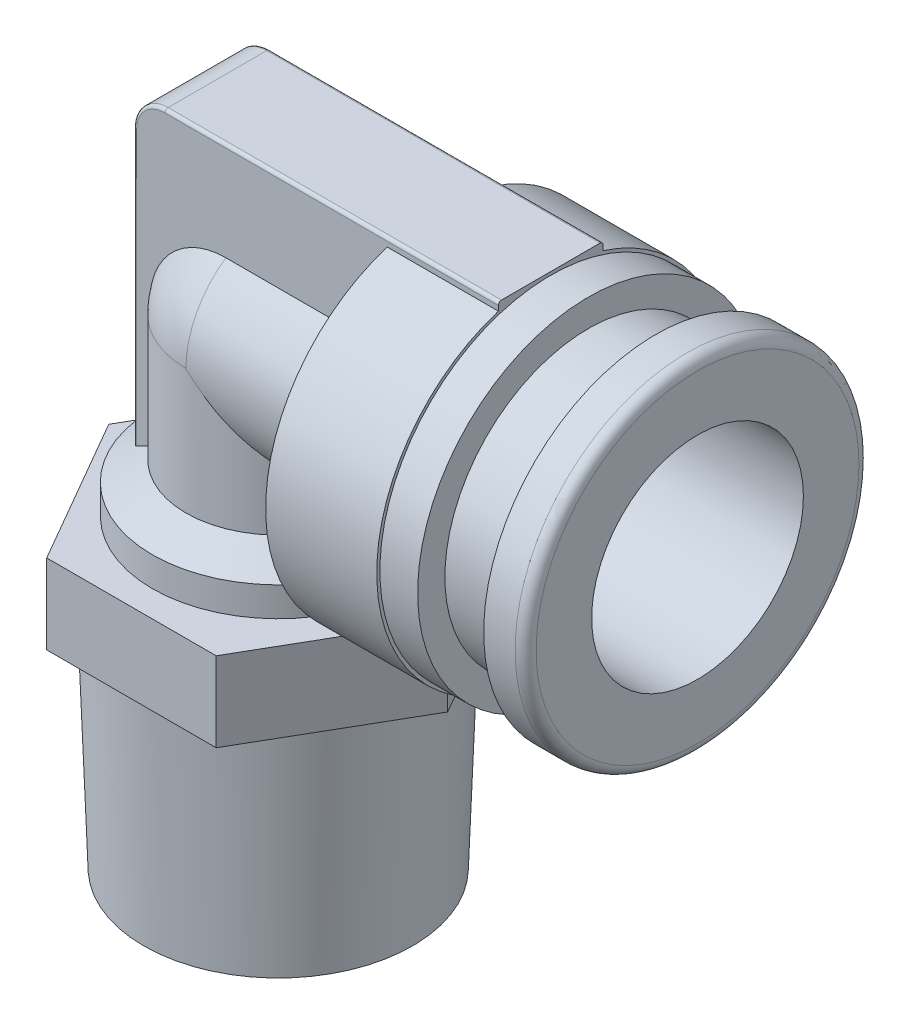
ISO-10303-21;
HEADER;
FILE_DESCRIPTION(('STEP AP214'),'2;1');
FILE_NAME('part.step','',(''),(''),'','','');
FILE_SCHEMA(('AUTOMOTIVE_DESIGN { 1 0 10303 214 1 1 1 1 }'));
ENDSEC;
DATA;
#1=APPLICATION_CONTEXT('core data for automotive mechanical design processes');
#2=APPLICATION_PROTOCOL_DEFINITION('international standard','automotive_design',2000,#1);
#3=PRODUCT_CONTEXT('',#1,'mechanical');
#4=PRODUCT('Part','Part','',(#3));
#5=PRODUCT_RELATED_PRODUCT_CATEGORY('part','',(#4));
#6=PRODUCT_DEFINITION_FORMATION('','',#4);
#7=PRODUCT_DEFINITION_CONTEXT('part definition',#1,'design');
#8=PRODUCT_DEFINITION('design','',#6,#7);
#9=PRODUCT_DEFINITION_SHAPE('','',#8);
#10=(LENGTH_UNIT() NAMED_UNIT(*) SI_UNIT(.MILLI.,.METRE.));
#11=(NAMED_UNIT(*) PLANE_ANGLE_UNIT() SI_UNIT($,.RADIAN.));
#12=(NAMED_UNIT(*) SI_UNIT($,.STERADIAN.) SOLID_ANGLE_UNIT());
#13=UNCERTAINTY_MEASURE_WITH_UNIT(LENGTH_MEASURE(1.E-05),#10,'distance_accuracy_value','');
#14=(GEOMETRIC_REPRESENTATION_CONTEXT(3) GLOBAL_UNCERTAINTY_ASSIGNED_CONTEXT((#13)) GLOBAL_UNIT_ASSIGNED_CONTEXT((#10,
#11,#12)) REPRESENTATION_CONTEXT('',''));
#15=CARTESIAN_POINT('',(0.,0.,0.));
#16=DIRECTION('',(0.,0.,1.));
#17=DIRECTION('',(1.,0.,0.));
#18=AXIS2_PLACEMENT_3D('',#15,#16,#17);
#19=CARTESIAN_POINT('',(14.8,18.1001,0.));
#20=DIRECTION('',(1.,0.,0.));
#21=DIRECTION('',(0.,0.,-1.));
#22=AXIS2_PLACEMENT_3D('',#19,#20,#21);
#23=PLANE('',#22);
#24=CARTESIAN_POINT('',(14.8,18.1001,0.));
#25=DIRECTION('',(1.,0.,0.));
#26=DIRECTION('',(0.,0.,-1.));
#27=AXIS2_PLACEMENT_3D('',#24,#25,#26);
#28=CIRCLE('',#27,8.15);
#29=CARTESIAN_POINT('',(14.8,18.1001,-8.15));
#30=VERTEX_POINT('',#29);
#31=EDGE_CURVE('E264',#30,#30,#28,.T.);
#32=ORIENTED_EDGE('',*,*,#31,.T.);
#33=EDGE_LOOP('',(#32));
#34=FACE_BOUND('',#33,.T.);
#35=CARTESIAN_POINT('',(14.8,18.1001,0.));
#36=DIRECTION('',(1.,0.,0.));
#37=DIRECTION('',(0.,0.,-1.));
#38=AXIS2_PLACEMENT_3D('',#35,#36,#37);
#39=CIRCLE('',#38,6.85);
#40=CARTESIAN_POINT('',(14.8,18.1001,-6.85));
#41=VERTEX_POINT('',#40);
#42=EDGE_CURVE('E271',#41,#41,#39,.T.);
#43=ORIENTED_EDGE('',*,*,#42,.F.);
#44=EDGE_LOOP('',(#43));
#45=FACE_BOUND('',#44,.T.);
#46=ADVANCED_FACE('F33',(#34,#45),#23,.T.);
#47=CARTESIAN_POINT('',(13.,18.1001,2.5));
#48=DIRECTION('',(1.,0.,0.));
#49=DIRECTION('',(0.,0.,-1.));
#50=AXIS2_PLACEMENT_3D('',#47,#48,#49);
#51=PLANE('',#50);
#52=DIRECTION('',(0.,0.,1.));
#53=VECTOR('',#52,1.);
#54=CARTESIAN_POINT('',(13.,26.4001,2.5));
#55=LINE('',#54,#53);
#56=CARTESIAN_POINT('',(13.,26.4001,-2.35));
#57=VERTEX_POINT('',#56);
#58=CARTESIAN_POINT('',(13.,26.4001,2.35));
#59=VERTEX_POINT('',#58);
#60=EDGE_CURVE('E483',#57,#59,#55,.T.);
#61=ORIENTED_EDGE('',*,*,#60,.T.);
#62=CARTESIAN_POINT('',(13.,26.2501,2.35));
#63=DIRECTION('',(1.,0.,0.));
#64=DIRECTION('',(0.,0.,-1.));
#65=AXIS2_PLACEMENT_3D('',#62,#63,#64);
#66=CIRCLE('',#65,0.15);
#67=CARTESIAN_POINT('',(13.,26.2501,2.5));
#68=VERTEX_POINT('',#67);
#69=EDGE_CURVE('E369',#59,#68,#66,.T.);
#70=ORIENTED_EDGE('',*,*,#69,.T.);
#71=DIRECTION('',(0.,-1.,0.));
#72=VECTOR('',#71,1.);
#73=CARTESIAN_POINT('',(13.,26.4001,2.5));
#74=LINE('',#73,#72);
#75=CARTESIAN_POINT('',(13.,26.0146435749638,2.5));
#76=VERTEX_POINT('',#75);
#77=EDGE_CURVE('E481',#68,#76,#74,.T.);
#78=ORIENTED_EDGE('',*,*,#77,.T.);
#79=CARTESIAN_POINT('',(13.,18.1001,0.));
#80=DIRECTION('',(1.,0.,0.));
#81=DIRECTION('',(0.,0.,-1.));
#82=AXIS2_PLACEMENT_3D('',#79,#80,#81);
#83=CIRCLE('',#82,8.3);
#84=CARTESIAN_POINT('',(13.,26.0146435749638,-2.5));
#85=VERTEX_POINT('',#84);
#86=EDGE_CURVE('E524',#76,#85,#83,.T.);
#87=ORIENTED_EDGE('',*,*,#86,.T.);
#88=DIRECTION('',(0.,1.,0.));
#89=VECTOR('',#88,1.);
#90=CARTESIAN_POINT('',(13.,26.4001,-2.5));
#91=LINE('',#90,#89);
#92=CARTESIAN_POINT('',(13.,26.2501,-2.5));
#93=VERTEX_POINT('',#92);
#94=EDGE_CURVE('E491',#85,#93,#91,.T.);
#95=ORIENTED_EDGE('',*,*,#94,.T.);
#96=CARTESIAN_POINT('',(13.,26.2501,-2.35));
#97=DIRECTION('',(1.,0.,0.));
#98=DIRECTION('',(0.,0.,-1.));
#99=AXIS2_PLACEMENT_3D('',#96,#97,#98);
#100=CIRCLE('',#99,0.15);
#101=EDGE_CURVE('E57',#93,#57,#100,.T.);
#102=ORIENTED_EDGE('',*,*,#101,.T.);
#103=EDGE_LOOP('',(#61,#70,#78,#87,#95,#102));
#104=FACE_BOUND('',#103,.T.);
#105=CARTESIAN_POINT('',(13.,18.1001,0.));
#106=DIRECTION('',(1.,0.,0.));
#107=DIRECTION('',(0.,0.,-1.));
#108=AXIS2_PLACEMENT_3D('',#105,#106,#107);
#109=CIRCLE('',#108,8.15);
#110=CARTESIAN_POINT('',(13.,18.1001,-8.15));
#111=VERTEX_POINT('',#110);
#112=EDGE_CURVE('E265',#111,#111,#109,.T.);
#113=ORIENTED_EDGE('',*,*,#112,.F.);
#114=EDGE_LOOP('',(#113));
#115=FACE_BOUND('',#114,.T.);
#116=ADVANCED_FACE('F405',(#104,#115),#51,.T.);
#117=CARTESIAN_POINT('',(0.,10.1241,2.5));
#118=DIRECTION('',(0.,0.,1.));
#119=DIRECTION('',(1.,0.,0.));
#120=AXIS2_PLACEMENT_3D('',#117,#118,#119);
#121=PLANE('',#120);
#122=CARTESIAN_POINT('',(-2.9,24.9001,2.5));
#123=DIRECTION('',(0.,0.,1.));
#124=DIRECTION('',(1.,0.,0.));
#125=AXIS2_PLACEMENT_3D('',#122,#123,#124);
#126=CIRCLE('',#125,1.35);
#127=CARTESIAN_POINT('',(-2.9,26.2501,2.5));
#128=VERTEX_POINT('',#127);
#129=CARTESIAN_POINT('',(-4.25,24.9001,2.5));
#130=VERTEX_POINT('',#129);
#131=EDGE_CURVE('E460',#128,#130,#126,.T.);
#132=ORIENTED_EDGE('',*,*,#131,.T.);
#133=DIRECTION('',(0.,1.,0.));
#134=VECTOR('',#133,1.);
#135=CARTESIAN_POINT('',(-4.25,10.1241,2.5));
#136=LINE('',#135,#134);
#137=CARTESIAN_POINT('',(-4.24999999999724,11.8173198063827,2.5));
#138=VERTEX_POINT('',#137);
#139=EDGE_CURVE('E462',#130,#138,#136,.F.);
#140=ORIENTED_EDGE('',*,*,#139,.T.);
#141=CARTESIAN_POINT('',(2.69779631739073,12.5405742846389,2.5));
#142=CARTESIAN_POINT('',(2.61053010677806,12.5775170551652,2.5));
#143=CARTESIAN_POINT('',(2.52296960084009,12.6137803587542,2.5));
#144=CARTESIAN_POINT('',(2.34713917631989,12.6846189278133,2.5));
#145=CARTESIAN_POINT('',(2.25886905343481,12.7191936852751,2.5));
#146=CARTESIAN_POINT('',(2.08103692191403,12.7864979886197,2.5));
#147=CARTESIAN_POINT('',(1.99147039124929,12.8192156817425,2.5));
#148=CARTESIAN_POINT('',(1.81146612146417,12.8821282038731,2.5));
#149=CARTESIAN_POINT('',(1.72102844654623,12.9123232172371,2.5));
#150=CARTESIAN_POINT('',(1.45135123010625,12.9973766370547,2.5));
#151=CARTESIAN_POINT('',(1.27069211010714,13.0478947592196,2.5));
#152=CARTESIAN_POINT('',(0.905703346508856,13.1319387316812,2.5));
#153=CARTESIAN_POINT('',(0.721382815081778,13.1655023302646,2.5));
#154=CARTESIAN_POINT('',(0.388036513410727,13.2058209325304,2.5));
#155=CARTESIAN_POINT('',(0.239518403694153,13.2166602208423,2.5));
#156=CARTESIAN_POINT('',(-0.057856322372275,13.2228869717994,2.5));
#157=CARTESIAN_POINT('',(-0.206712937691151,13.2182744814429,2.5));
#158=CARTESIAN_POINT('',(-0.503012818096,13.1942406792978,2.5));
#159=CARTESIAN_POINT('',(-0.650457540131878,13.1748367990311,2.5));
#160=CARTESIAN_POINT('',(-0.869928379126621,13.1363710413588,2.5));
#161=CARTESIAN_POINT('',(-0.942823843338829,13.1219835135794,2.5));
#162=CARTESIAN_POINT('',(-1.08801226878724,13.0904375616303,2.5));
#163=CARTESIAN_POINT('',(-1.16030525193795,13.0732792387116,2.5));
#164=CARTESIAN_POINT('',(-1.34115430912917,13.0271178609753,2.5));
#165=CARTESIAN_POINT('',(-1.44931006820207,12.9965506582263,2.5));
#166=CARTESIAN_POINT('',(-1.66426202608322,12.9309501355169,2.5));
#167=CARTESIAN_POINT('',(-1.77105796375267,12.8959159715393,2.5));
#168=CARTESIAN_POINT('',(-1.98351807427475,12.8222622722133,2.5));
#169=CARTESIAN_POINT('',(-2.08918100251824,12.7836391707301,2.5));
#170=CARTESIAN_POINT('',(-2.29941399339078,12.7035673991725,2.5));
#171=CARTESIAN_POINT('',(-2.40398414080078,12.6621189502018,2.5));
#172=CARTESIAN_POINT('',(-2.71697929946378,12.5341493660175,2.5));
#173=CARTESIAN_POINT('',(-2.92401806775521,12.4442451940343,2.5));
#174=CARTESIAN_POINT('',(-3.33533631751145,12.2586826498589,2.5));
#175=CARTESIAN_POINT('',(-3.5396171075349,12.1630271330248,2.5));
#176=CARTESIAN_POINT('',(-3.94888918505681,11.9665312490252,2.5));
#177=CARTESIAN_POINT('',(-4.15385602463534,11.8656401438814,2.5));
#178=CARTESIAN_POINT('',(-4.56239796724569,11.6610378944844,2.5));
#179=CARTESIAN_POINT('',(-4.76597291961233,11.5573264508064,2.5));
#180=CARTESIAN_POINT('',(-5.171730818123,11.3480540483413,2.5));
#181=CARTESIAN_POINT('',(-5.37391553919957,11.2424965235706,2.5));
#182=CARTESIAN_POINT('',(-5.77749542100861,11.0298824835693,2.5));
#183=CARTESIAN_POINT('',(-5.97889057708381,10.9228259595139,2.5));
#184=CARTESIAN_POINT('',(-6.33375375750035,10.7328963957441,2.5));
#185=CARTESIAN_POINT('',(-6.48734871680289,10.6502602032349,2.5));
#186=CARTESIAN_POINT('',(-6.71703914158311,10.5261514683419,2.5));
#187=CARTESIAN_POINT('',(-6.79324674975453,10.484886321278,2.5));
#188=CARTESIAN_POINT('',(-6.94557856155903,10.4022403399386,2.5));
#189=CARTESIAN_POINT('',(-7.0217027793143,10.3608595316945,2.5));
#190=CARTESIAN_POINT('',(-7.09779631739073,10.3194223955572,2.5));
#191=B_SPLINE_CURVE_WITH_KNOTS('',3,(#141,#142,#143,#144,#145,#146,#147,#148,#149,#150,#151,
#152,#153,#154,#155,#156,#157,#158,#159,#160,#161,#162,#163,#164,#165,#166,#167,#168,#169,#170,
#171,#172,#173,#174,#175,#176,#177,#178,#179,#180,#181,#182,#183,#184,#185,#186,#187,#188,#189,
#190),.UNSPECIFIED.,.F.,.F.,(4,2,2,2,2,2,2,2,2,2,2,2,2,2,2,2,2,2,2,2,2,2,2,2,4),(0.,
0.284296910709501,0.5686788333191,0.854708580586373,1.14071740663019,1.70291274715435,
2.26385081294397,2.70983814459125,3.15582411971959,3.60128531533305,3.82414726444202,
4.04700107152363,4.38404945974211,4.72116162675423,5.05861242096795,5.39603683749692,
6.07302255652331,6.7496749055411,7.4349993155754,8.12039677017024,8.80463212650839,
9.48887151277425,10.0121114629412,10.2720992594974,10.532032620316),.UNSPECIFIED.);
#192=CARTESIAN_POINT('',(-3.62005864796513,12.1241,2.5));
#193=VERTEX_POINT('',#192);
#194=EDGE_CURVE('E356',#193,#138,#191,.T.);
#195=ORIENTED_EDGE('',*,*,#194,.F.);
#196=DIRECTION('',(0.,-1.,0.));
#197=VECTOR('',#196,1.);
#198=CARTESIAN_POINT('',(-3.62005864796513,18.1001,2.5));
#199=LINE('',#198,#197);
#200=CARTESIAN_POINT('',(-3.62005864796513,18.1001,2.5));
#201=VERTEX_POINT('',#200);
#202=EDGE_CURVE('E1042',#193,#201,#199,.F.);
#203=ORIENTED_EDGE('',*,*,#202,.T.);
#204=DIRECTION('',(1.,0.,0.));
#205=VECTOR('',#204,1.);
#206=CARTESIAN_POINT('',(0.,18.1001,2.5));
#207=LINE('',#206,#205);
#208=CARTESIAN_POINT('',(-3.62077339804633,18.1001,2.5));
#209=VERTEX_POINT('',#208);
#210=EDGE_CURVE('E256',#209,#201,#207,.T.);
#211=ORIENTED_EDGE('',*,*,#210,.F.);
#212=CARTESIAN_POINT('',(0.,18.1001,2.5));
#213=DIRECTION('',(0.,0.,1.));
#214=DIRECTION('',(1.,0.,0.));
#215=AXIS2_PLACEMENT_3D('',#212,#213,#214);
#216=CIRCLE('',#215,3.62077339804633);
#217=CARTESIAN_POINT('',(0.,21.7208733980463,2.5));
#218=VERTEX_POINT('',#217);
#219=EDGE_CURVE('E228',#209,#218,#216,.F.);
#220=ORIENTED_EDGE('',*,*,#219,.T.);
#221=DIRECTION('',(1.,0.,0.));
#222=VECTOR('',#221,1.);
#223=CARTESIAN_POINT('',(-12.4450793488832,21.7208733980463,2.5));
#224=LINE('',#223,#222);
#225=CARTESIAN_POINT('',(6.66,21.7208733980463,2.5));
#226=VERTEX_POINT('',#225);
#227=EDGE_CURVE('E242',#218,#226,#224,.T.);
#228=ORIENTED_EDGE('',*,*,#227,.T.);
#229=DIRECTION('',(0.,-1.,0.));
#230=VECTOR('',#229,1.);
#231=CARTESIAN_POINT('',(6.66,10.1241,2.5));
#232=LINE('',#231,#230);
#233=CARTESIAN_POINT('',(6.66,24.0986560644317,2.5));
#234=VERTEX_POINT('',#233);
#235=EDGE_CURVE('E1022',#234,#226,#232,.T.);
#236=ORIENTED_EDGE('',*,*,#235,.F.);
#237=CARTESIAN_POINT('',(11.7872210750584,2.92538134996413,2.5));
#238=CARTESIAN_POINT('',(11.6018642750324,3.25076094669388,2.5));
#239=CARTESIAN_POINT('',(11.4166223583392,3.57620604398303,2.5));
#240=CARTESIAN_POINT('',(11.046428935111,4.22726182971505,2.5));
#241=CARTESIAN_POINT('',(10.8614774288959,4.55287251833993,2.5));
#242=CARTESIAN_POINT('',(10.3071207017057,5.53005560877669,2.5));
#243=CARTESIAN_POINT('',(9.93824278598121,6.18192727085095,2.5));
#244=CARTESIAN_POINT('',(9.20372473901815,7.48506642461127,2.5));
#245=CARTESIAN_POINT('',(8.83807840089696,8.13633040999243,2.5));
#246=CARTESIAN_POINT('',(8.2924895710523,9.11481128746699,2.5));
#247=CARTESIAN_POINT('',(8.11111141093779,9.44122723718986,2.5));
#248=CARTESIAN_POINT('',(7.74968701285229,10.0947956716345,2.5));
#249=CARTESIAN_POINT('',(7.56964077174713,10.4219481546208,2.5));
#250=CARTESIAN_POINT('',(7.20986131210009,11.0801605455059,2.5));
#251=CARTESIAN_POINT('',(7.03014471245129,11.4112295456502,2.5));
#252=CARTESIAN_POINT('',(6.67352779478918,12.0749302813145,2.5));
#253=CARTESIAN_POINT('',(6.49662775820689,12.4075621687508,2.5));
#254=CARTESIAN_POINT('',(6.23442630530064,12.9087216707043,2.5));
#255=CARTESIAN_POINT('',(6.14743798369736,13.0763659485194,2.5));
#256=CARTESIAN_POINT('',(5.97493957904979,13.4124108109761,2.5));
#257=CARTESIAN_POINT('',(5.88942946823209,13.5808113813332,2.5));
#258=CARTESIAN_POINT('',(5.72035951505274,13.9185567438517,2.5));
#259=CARTESIAN_POINT('',(5.63679935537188,14.0879013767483,2.5));
#260=CARTESIAN_POINT('',(5.47228651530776,14.427851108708,2.5));
#261=CARTESIAN_POINT('',(5.39133375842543,14.5984561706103,2.5));
#262=CARTESIAN_POINT('',(5.2296875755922,14.9485394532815,2.5));
#263=CARTESIAN_POINT('',(5.1491481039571,15.1280891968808,2.5));
#264=CARTESIAN_POINT('',(4.99367567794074,15.489585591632,2.5));
#265=CARTESIAN_POINT('',(4.91874164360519,15.671531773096,2.5));
#266=CARTESIAN_POINT('',(4.77729257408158,16.0381968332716,2.5));
#267=CARTESIAN_POINT('',(4.71075726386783,16.2229077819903,2.5));
#268=CARTESIAN_POINT('',(4.58999074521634,16.5963591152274,2.5));
#269=CARTESIAN_POINT('',(4.53575375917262,16.7850975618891,2.5));
#270=CARTESIAN_POINT('',(4.45831398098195,17.1122433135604,2.5));
#271=CARTESIAN_POINT('',(4.4306717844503,17.2495807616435,2.5));
#272=CARTESIAN_POINT('',(4.38694116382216,17.5260837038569,2.5));
#273=CARTESIAN_POINT('',(4.37084771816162,17.6652483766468,2.5));
#274=CARTESIAN_POINT('',(4.35198930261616,17.9438869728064,2.5));
#275=CARTESIAN_POINT('',(4.3491654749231,18.0833567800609,2.5));
#276=CARTESIAN_POINT('',(4.35703737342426,18.3619318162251,2.5));
#277=CARTESIAN_POINT('',(4.3677353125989,18.5010369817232,2.5));
#278=CARTESIAN_POINT('',(4.39630037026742,18.7358055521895,2.5));
#279=CARTESIAN_POINT('',(4.41101765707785,18.8318744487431,2.5));
#280=CARTESIAN_POINT('',(4.4457018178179,19.0230728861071,2.5));
#281=CARTESIAN_POINT('',(4.46566967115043,19.1182022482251,2.5));
#282=CARTESIAN_POINT('',(4.51010491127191,19.3074865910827,2.5));
#283=CARTESIAN_POINT('',(4.53457660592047,19.4016405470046,2.5));
#284=CARTESIAN_POINT('',(4.58725685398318,19.5888805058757,2.5));
#285=CARTESIAN_POINT('',(4.61546513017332,19.6819665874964,2.5));
#286=CARTESIAN_POINT('',(4.67532578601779,19.8682809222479,2.5));
#287=CARTESIAN_POINT('',(4.70701624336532,19.9614968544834,2.5));
#288=CARTESIAN_POINT('',(4.77297610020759,20.1470068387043,2.5));
#289=CARTESIAN_POINT('',(4.80724550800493,20.2393008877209,2.5));
#290=CARTESIAN_POINT('',(4.87787329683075,20.4230260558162,2.5));
#291=CARTESIAN_POINT('',(4.91423054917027,20.5144576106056,2.5));
#292=CARTESIAN_POINT('',(4.98867590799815,20.6966073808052,2.5));
#293=CARTESIAN_POINT('',(5.02676396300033,20.7873256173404,2.5));
#294=CARTESIAN_POINT('',(5.15544560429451,21.087221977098,2.5));
#295=CARTESIAN_POINT('',(5.24913002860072,21.295072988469,2.5));
#296=CARTESIAN_POINT('',(5.44146666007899,21.7084719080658,2.5));
#297=CARTESIAN_POINT('',(5.54011962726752,21.9140194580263,2.5));
#298=CARTESIAN_POINT('',(5.74087339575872,22.3235259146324,2.5));
#299=CARTESIAN_POINT('',(5.84297562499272,22.5274841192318,2.5));
#300=CARTESIAN_POINT('',(6.04959408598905,22.9341750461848,2.5));
#301=CARTESIAN_POINT('',(6.15411037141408,23.1369077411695,2.5));
#302=CARTESIAN_POINT('',(6.36503714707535,23.5417053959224,2.5));
#303=CARTESIAN_POINT('',(6.47144983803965,23.743769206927,2.5));
#304=CARTESIAN_POINT('',(6.68560560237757,24.1471930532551,2.5));
#305=CARTESIAN_POINT('',(6.793348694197,24.348553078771,2.5));
#306=CARTESIAN_POINT('',(7.1180311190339,24.9517112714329,2.5));
#307=CARTESIAN_POINT('',(7.33648057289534,25.352695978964,2.5));
#308=CARTESIAN_POINT('',(7.77464741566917,26.1510664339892,2.5));
#309=CARTESIAN_POINT('',(7.99435098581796,26.5484597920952,2.5));
#310=CARTESIAN_POINT('',(8.43542709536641,27.3423528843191,2.5));
#311=CARTESIAN_POINT('',(8.65679974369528,27.7388525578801,2.5));
#312=CARTESIAN_POINT('',(9.1005553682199,28.5309493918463,2.5));
#313=CARTESIAN_POINT('',(9.32293760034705,28.9265469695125,2.5));
#314=CARTESIAN_POINT('',(9.76853882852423,29.7172707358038,2.5));
#315=CARTESIAN_POINT('',(9.99175782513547,30.1123969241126,2.5));
#316=CARTESIAN_POINT('',(10.4374234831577,30.8998258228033,2.5));
#317=CARTESIAN_POINT('',(10.6598662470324,31.2921307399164,2.5));
#318=CARTESIAN_POINT('',(11.1052606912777,32.076531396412,2.5));
#319=CARTESIAN_POINT('',(11.3282124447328,32.4686270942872,2.5));
#320=CARTESIAN_POINT('',(11.7750377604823,33.25357418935,2.5));
#321=CARTESIAN_POINT('',(11.998912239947,33.6464250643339,2.5));
#322=CARTESIAN_POINT('',(12.4469278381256,34.4318934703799,2.5));
#323=CARTESIAN_POINT('',(12.6710689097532,34.824511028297,2.5));
#324=CARTESIAN_POINT('',(12.89532500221,35.2170628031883,2.5));
#325=B_SPLINE_CURVE_WITH_KNOTS('',3,(#237,#238,#239,#240,#241,#242,#243,#244,#245,#246,#247,
#248,#249,#250,#251,#252,#253,#254,#255,#256,#257,#258,#259,#260,#261,#262,#263,#264,#265,#266,
#267,#268,#269,#270,#271,#272,#273,#274,#275,#276,#277,#278,#279,#280,#281,#282,#283,#284,#285,
#286,#287,#288,#289,#290,#291,#292,#293,#294,#295,#296,#297,#298,#299,#300,#301,#302,#303,#304,
#305,#306,#307,#308,#309,#310,#311,#312,#313,#314,#315,#316,#317,#318,#319,#320,#321,#322,#323,
#324),.UNSPECIFIED.,.F.,.F.,(4,2,2,2,2,2,2,2,2,2,2,2,2,2,2,2,2,2,2,2,2,2,2,2,2,2,2,2,2,2,2,2,2,
2,2,2,2,2,2,2,2,2,2,4),(0.,1.12341502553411,2.2468312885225,4.49384257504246,6.73449822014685,
7.85476789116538,8.97503492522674,10.1051350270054,11.2353473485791,11.8019495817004,
12.3685411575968,12.9350398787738,13.50152196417,14.0918172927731,14.6819985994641,
15.2707267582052,15.8591777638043,16.2790614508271,16.6987624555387,17.1166000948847,
17.534506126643,17.8259273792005,18.1174030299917,18.4091589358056,18.7008932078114,
18.9962139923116,19.2915357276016,19.5866992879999,19.8818540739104,20.5657007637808,
21.2496523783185,21.9338906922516,22.6181442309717,23.3032515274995,23.9883683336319,
25.3582345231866,26.7204783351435,28.0828118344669,29.4442663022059,30.8057216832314,
32.1586645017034,33.5118156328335,34.8683051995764,36.2245829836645),.UNSPECIFIED.);
#326=CARTESIAN_POINT('',(7.7,26.0146435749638,2.5));
#327=VERTEX_POINT('',#326);
#328=EDGE_CURVE('E1015',#234,#327,#325,.T.);
#329=ORIENTED_EDGE('',*,*,#328,.T.);
#330=DIRECTION('',(1.,0.,0.));
#331=VECTOR('',#330,1.);
#332=CARTESIAN_POINT('',(7.7,26.0146435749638,2.5));
#333=LINE('',#332,#331);
#334=EDGE_CURVE('E490',#76,#327,#333,.F.);
#335=ORIENTED_EDGE('',*,*,#334,.F.);
#336=ORIENTED_EDGE('',*,*,#77,.F.);
#337=DIRECTION('',(1.,0.,0.));
#338=VECTOR('',#337,1.);
#339=CARTESIAN_POINT('',(0.,26.2501,2.5));
#340=LINE('',#339,#338);
#341=EDGE_CURVE('E458',#68,#128,#340,.F.);
#342=ORIENTED_EDGE('',*,*,#341,.T.);
#343=EDGE_LOOP('',(#132,#140,#195,#203,#211,#220,#228,#236,#329,#335,#336,#342));
#344=FACE_BOUND('',#343,.T.);
#345=ADVANCED_FACE('F411',(#344),#121,.T.);
#346=CARTESIAN_POINT('',(0.,10.1241,-2.5));
#347=DIRECTION('',(0.,0.,-1.));
#348=DIRECTION('',(-1.,0.,0.));
#349=AXIS2_PLACEMENT_3D('',#346,#347,#348);
#350=PLANE('',#349);
#351=CARTESIAN_POINT('',(-7.09779631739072,10.3194223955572,-2.5));
#352=CARTESIAN_POINT('',(-6.94019751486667,10.4052375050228,-2.5));
#353=CARTESIAN_POINT('',(-6.78247111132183,10.4908194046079,-2.5));
#354=CARTESIAN_POINT('',(-6.46669645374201,10.6613937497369,-2.5));
#355=CARTESIAN_POINT('',(-6.30864819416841,10.7463861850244,-2.5));
#356=CARTESIAN_POINT('',(-5.99205761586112,10.9157149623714,-2.5));
#357=CARTESIAN_POINT('',(-5.83351502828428,11.0000508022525,-2.5));
#358=CARTESIAN_POINT('',(-5.51596011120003,11.1678315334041,-2.5));
#359=CARTESIAN_POINT('',(-5.35694778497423,11.25127643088,-2.5));
#360=CARTESIAN_POINT('',(-5.03255171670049,11.4200583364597,-2.5));
#361=CARTESIAN_POINT('',(-4.86714639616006,11.5053539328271,-2.5));
#362=CARTESIAN_POINT('',(-4.53554429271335,11.6743917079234,-2.5));
#363=CARTESIAN_POINT('',(-4.36934751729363,11.7581339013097,-2.5));
#364=CARTESIAN_POINT('',(-4.03598424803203,11.9235482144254,-2.5));
#365=CARTESIAN_POINT('',(-3.86881805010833,12.0052209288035,-2.5));
#366=CARTESIAN_POINT('',(-3.53316859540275,12.1658058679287,-2.5));
#367=CARTESIAN_POINT('',(-3.36468539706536,12.2447182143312,-2.5));
#368=CARTESIAN_POINT('',(-3.01977851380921,12.4015565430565,-2.5));
#369=CARTESIAN_POINT('',(-2.84328991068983,12.4793407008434,-2.5));
#370=CARTESIAN_POINT('',(-2.48776181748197,12.6290634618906,-2.5));
#371=CARTESIAN_POINT('',(-2.30872161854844,12.701000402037,-2.5));
#372=CARTESIAN_POINT('',(-1.94940754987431,12.8354722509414,-2.5));
#373=CARTESIAN_POINT('',(-1.76917063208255,12.8981044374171,-2.5));
#374=CARTESIAN_POINT('',(-1.40477643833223,13.010842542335,-2.5));
#375=CARTESIAN_POINT('',(-1.22062120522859,13.0609548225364,-2.5));
#376=CARTESIAN_POINT('',(-0.898771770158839,13.1319863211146,-2.5));
#377=CARTESIAN_POINT('',(-0.762029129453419,13.157137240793,-2.5));
#378=CARTESIAN_POINT('',(-0.486888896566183,13.1956222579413,-2.5));
#379=CARTESIAN_POINT('',(-0.348491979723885,13.2089610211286,-2.5));
#380=CARTESIAN_POINT('',(-0.0704045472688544,13.2223775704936,-2.5));
#381=CARTESIAN_POINT('',(0.0692889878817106,13.2223951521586,-2.5));
#382=CARTESIAN_POINT('',(0.348010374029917,13.2090202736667,-2.5));
#383=CARTESIAN_POINT('',(0.487038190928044,13.1956271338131,-2.5));
#384=CARTESIAN_POINT('',(0.804338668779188,13.1511856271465,-2.5));
#385=CARTESIAN_POINT('',(0.982030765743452,13.1160811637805,-2.5));
#386=CARTESIAN_POINT('',(1.33393686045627,13.0307332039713,-2.5));
#387=CARTESIAN_POINT('',(1.50814361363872,12.9804610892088,-2.5));
#388=CARTESIAN_POINT('',(1.76709282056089,12.897041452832,-2.5));
#389=CARTESIAN_POINT('',(1.85315075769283,12.8678468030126,-2.5));
#390=CARTESIAN_POINT('',(2.02448586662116,12.8072269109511,-2.5));
#391=CARTESIAN_POINT('',(2.10976299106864,12.7758015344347,-2.5));
#392=CARTESIAN_POINT('',(2.27919402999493,12.7112671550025,-2.5));
#393=CARTESIAN_POINT('',(2.36335140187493,12.6781671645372,-2.5));
#394=CARTESIAN_POINT('',(2.53102721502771,12.6104427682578,-2.5));
#395=CARTESIAN_POINT('',(2.61454580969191,12.5758187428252,-2.5));
#396=CARTESIAN_POINT('',(2.69779631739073,12.5405742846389,-2.5));
#397=B_SPLINE_CURVE_WITH_KNOTS('',3,(#351,#352,#353,#354,#355,#356,#357,#358,#359,#360,#361,
#362,#363,#364,#365,#366,#367,#368,#369,#370,#371,#372,#373,#374,#375,#376,#377,#378,#379,#380,
#381,#382,#383,#384,#385,#386,#387,#388,#389,#390,#391,#392,#393,#394,#395,#396),.UNSPECIFIED.,
.F.,.F.,(4,2,2,2,2,2,2,2,2,2,2,2,2,2,2,2,2,2,2,2,2,2,4),(0.,0.538344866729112,1.07669907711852,
1.6154310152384,2.15415919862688,2.71246141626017,3.27075836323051,3.82889302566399,
4.38700305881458,4.96554122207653,5.54424336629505,6.11638977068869,6.68824485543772,
7.10493496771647,7.52146041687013,7.9398683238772,8.35829743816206,8.90073663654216,
9.44420577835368,9.71680912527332,9.98942889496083,10.2607117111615,10.5319271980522),.UNSPECIFIED.);
#398=CARTESIAN_POINT('',(-4.25,11.8173198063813,-2.5));
#399=VERTEX_POINT('',#398);
#400=CARTESIAN_POINT('',(-3.62005864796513,12.1241,-2.5));
#401=VERTEX_POINT('',#400);
#402=EDGE_CURVE('E347',#399,#401,#397,.T.);
#403=ORIENTED_EDGE('',*,*,#402,.F.);
#404=DIRECTION('',(0.,1.,0.));
#405=VECTOR('',#404,1.);
#406=CARTESIAN_POINT('',(-4.25,10.1241,-2.5));
#407=LINE('',#406,#405);
#408=CARTESIAN_POINT('',(-4.25,24.9001,-2.5));
#409=VERTEX_POINT('',#408);
#410=EDGE_CURVE('E472',#399,#409,#407,.T.);
#411=ORIENTED_EDGE('',*,*,#410,.T.);
#412=CARTESIAN_POINT('',(-2.9,24.9001,-2.5));
#413=DIRECTION('',(0.,0.,-1.));
#414=DIRECTION('',(-1.,0.,0.));
#415=AXIS2_PLACEMENT_3D('',#412,#413,#414);
#416=CIRCLE('',#415,1.35);
#417=CARTESIAN_POINT('',(-2.9,26.2501,-2.5));
#418=VERTEX_POINT('',#417);
#419=EDGE_CURVE('E470',#409,#418,#416,.T.);
#420=ORIENTED_EDGE('',*,*,#419,.T.);
#421=DIRECTION('',(1.,0.,0.));
#422=VECTOR('',#421,1.);
#423=CARTESIAN_POINT('',(0.,26.2501,-2.5));
#424=LINE('',#423,#422);
#425=EDGE_CURVE('E468',#418,#93,#424,.T.);
#426=ORIENTED_EDGE('',*,*,#425,.T.);
#427=ORIENTED_EDGE('',*,*,#94,.F.);
#428=DIRECTION('',(1.,0.,0.));
#429=VECTOR('',#428,1.);
#430=CARTESIAN_POINT('',(7.7,26.0146435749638,-2.5));
#431=LINE('',#430,#429);
#432=CARTESIAN_POINT('',(7.7,26.0146435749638,-2.5));
#433=VERTEX_POINT('',#432);
#434=EDGE_CURVE('E1034',#433,#85,#431,.T.);
#435=ORIENTED_EDGE('',*,*,#434,.F.);
#436=CARTESIAN_POINT('',(12.89532500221,35.2170628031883,-2.5));
#437=CARTESIAN_POINT('',(12.6866482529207,34.8517853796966,-2.5));
#438=CARTESIAN_POINT('',(12.4780730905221,34.4864498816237,-2.5));
#439=CARTESIAN_POINT('',(12.0611795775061,33.7556320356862,-2.5));
#440=CARTESIAN_POINT('',(11.8528612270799,33.3901496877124,-2.5));
#441=CARTESIAN_POINT('',(11.2283498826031,32.2933977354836,-2.5));
#442=CARTESIAN_POINT('',(10.8126230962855,31.5618625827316,-2.5));
#443=CARTESIAN_POINT('',(9.9831695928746,30.0977927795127,-2.5));
#444=CARTESIAN_POINT('',(9.56944260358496,29.3652582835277,-2.5));
#445=CARTESIAN_POINT('',(8.95141512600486,28.2650336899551,-2.5));
#446=CARTESIAN_POINT('',(8.74583683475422,27.8980616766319,-2.5));
#447=CARTESIAN_POINT('',(8.33586773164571,27.163455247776,-2.5));
#448=CARTESIAN_POINT('',(8.13147691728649,26.7958208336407,-2.5));
#449=CARTESIAN_POINT('',(7.72353277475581,26.0580880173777,-2.5));
#450=CARTESIAN_POINT('',(7.51998647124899,25.6879857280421,-2.5));
#451=CARTESIAN_POINT('',(7.11539240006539,24.9463784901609,-2.5));
#452=CARTESIAN_POINT('',(6.91434481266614,24.5748734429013,-2.5));
#453=CARTESIAN_POINT('',(6.61571713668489,24.015890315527,-2.5));
#454=CARTESIAN_POINT('',(6.51663428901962,23.8292156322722,-2.5));
#455=CARTESIAN_POINT('',(6.31978112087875,23.4551761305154,-2.5));
#456=CARTESIAN_POINT('',(6.22201079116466,23.2678113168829,-2.5));
#457=CARTESIAN_POINT('',(6.02820862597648,22.8922128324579,-2.5));
#458=CARTESIAN_POINT('',(5.93217657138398,22.7039792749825,-2.5));
#459=CARTESIAN_POINT('',(5.742449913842,22.3263408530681,-2.5));
#460=CARTESIAN_POINT('',(5.64875525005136,22.1369360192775,-2.5));
#461=CARTESIAN_POINT('',(5.46293017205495,21.7530830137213,-2.5));
#462=CARTESIAN_POINT('',(5.37085934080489,21.5586058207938,-2.5));
#463=CARTESIAN_POINT('',(5.19155422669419,21.1673690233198,-2.5));
#464=CARTESIAN_POINT('',(5.10432105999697,20.9706089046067,-2.5));
#465=CARTESIAN_POINT('',(4.9370055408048,20.5737955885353,-2.5));
#466=CARTESIAN_POINT('',(4.85692979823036,20.3737395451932,-2.5));
#467=CARTESIAN_POINT('',(4.74526332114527,20.0705507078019,-2.5));
#468=CARTESIAN_POINT('',(4.70945155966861,19.9689785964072,-2.5));
#469=CARTESIAN_POINT('',(4.64136964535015,19.7646601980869,-2.5));
#470=CARTESIAN_POINT('',(4.60909912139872,19.6619140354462,-2.5));
#471=CARTESIAN_POINT('',(4.53883808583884,19.4204043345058,-2.5));
#472=CARTESIAN_POINT('',(4.50256452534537,19.2811296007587,-2.5));
#473=CARTESIAN_POINT('',(4.44026627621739,19.0002921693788,-2.5));
#474=CARTESIAN_POINT('',(4.41423850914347,18.858730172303,-2.5));
#475=CARTESIAN_POINT('',(4.37503642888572,18.5749006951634,-2.5));
#476=CARTESIAN_POINT('',(4.36176355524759,18.4326473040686,-2.5));
#477=CARTESIAN_POINT('',(4.3492967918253,18.147519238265,-2.5));
#478=CARTESIAN_POINT('',(4.35010102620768,18.00464464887,-2.5));
#479=CARTESIAN_POINT('',(4.3656708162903,17.7198643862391,-2.5));
#480=CARTESIAN_POINT('',(4.38041923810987,17.5779577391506,-2.5));
#481=CARTESIAN_POINT('',(4.4221471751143,17.2959707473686,-2.5));
#482=CARTESIAN_POINT('',(4.44913067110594,17.1558910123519,-2.5));
#483=CARTESIAN_POINT('',(4.51320718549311,16.8766832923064,-2.5));
#484=CARTESIAN_POINT('',(4.55039574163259,16.7375777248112,-2.5));
#485=CARTESIAN_POINT('',(4.61187560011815,16.5306606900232,-2.5));
#486=CARTESIAN_POINT('',(4.63331856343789,16.4619780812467,-2.5));
#487=CARTESIAN_POINT('',(4.67785594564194,16.3251532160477,-2.5));
#488=CARTESIAN_POINT('',(4.70095028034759,16.2570109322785,-2.5));
#489=CARTESIAN_POINT('',(4.78044948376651,16.0302529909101,-2.5));
#490=CARTESIAN_POINT('',(4.84002552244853,15.8727488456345,-2.5));
#491=CARTESIAN_POINT('',(4.96466855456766,15.5599164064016,-2.5));
#492=CARTESIAN_POINT('',(5.0297370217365,15.4045887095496,-2.5));
#493=CARTESIAN_POINT('',(5.16388341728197,15.0955181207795,-2.5));
#494=CARTESIAN_POINT('',(5.23296487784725,14.9417767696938,-2.5));
#495=CARTESIAN_POINT('',(5.37402173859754,14.6356538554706,-2.5));
#496=CARTESIAN_POINT('',(5.44599684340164,14.4832721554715,-2.5));
#497=CARTESIAN_POINT('',(5.59230517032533,14.1791716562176,-2.5));
#498=CARTESIAN_POINT('',(5.66664391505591,14.0274555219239,-2.5));
#499=CARTESIAN_POINT('',(5.81699442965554,13.7248533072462,-2.5));
#500=CARTESIAN_POINT('',(5.89300622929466,13.5739672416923,-2.5));
#501=CARTESIAN_POINT('',(6.12289270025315,13.1224459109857,-2.5));
#502=CARTESIAN_POINT('',(6.278694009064,12.8227926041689,-2.5));
#503=CARTESIAN_POINT('',(6.59375213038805,12.2247884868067,-2.5));
#504=CARTESIAN_POINT('',(6.75301342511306,11.9264400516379,-2.5));
#505=CARTESIAN_POINT('',(7.07375293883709,11.3308920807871,-2.5));
#506=CARTESIAN_POINT('',(7.23523142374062,11.0336926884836,-2.5));
#507=CARTESIAN_POINT('',(7.55949564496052,10.4405642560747,-2.5));
#508=CARTESIAN_POINT('',(7.72227916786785,10.1446340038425,-2.5));
#509=CARTESIAN_POINT('',(8.04896818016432,9.55339300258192,-2.5));
#510=CARTESIAN_POINT('',(8.21287367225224,9.25808225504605,-2.5));
#511=CARTESIAN_POINT('',(8.65902443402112,8.45691243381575,-2.5));
#512=CARTESIAN_POINT('',(8.94207793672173,7.95150366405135,-2.5));
#513=CARTESIAN_POINT('',(9.50987676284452,6.94134665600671,-2.5));
#514=CARTESIAN_POINT('',(9.79462277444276,6.43659880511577,-2.5));
#515=CARTESIAN_POINT('',(10.3636511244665,5.43042001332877,-2.5));
#516=CARTESIAN_POINT('',(10.6479277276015,4.92898582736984,-2.5));
#517=CARTESIAN_POINT('',(11.2171283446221,3.92678153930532,-2.5));
#518=CARTESIAN_POINT('',(11.5020520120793,3.42601124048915,-2.5));
#519=CARTESIAN_POINT('',(11.7872210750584,2.92538134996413,-2.5));
#520=B_SPLINE_CURVE_WITH_KNOTS('',3,(#436,#437,#438,#439,#440,#441,#442,#443,#444,#445,#446,
#447,#448,#449,#450,#451,#452,#453,#454,#455,#456,#457,#458,#459,#460,#461,#462,#463,#464,#465,
#466,#467,#468,#469,#470,#471,#472,#473,#474,#475,#476,#477,#478,#479,#480,#481,#482,#483,#484,
#485,#486,#487,#488,#489,#490,#491,#492,#493,#494,#495,#496,#497,#498,#499,#500,#501,#502,#503,
#504,#505,#506,#507,#508,#509,#510,#511,#512,#513,#514,#515,#516,#517,#518,#519),.UNSPECIFIED.,
.F.,.F.,(4,2,2,2,2,2,2,2,2,2,2,2,2,2,2,2,2,2,2,2,2,2,2,2,2,2,2,2,2,2,2,2,2,2,2,2,2,2,2,2,2,4),
(0.,1.26204687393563,2.52409468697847,5.04832632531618,7.57220412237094,8.83409731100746,
10.0959878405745,11.3631296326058,12.6303623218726,13.2643802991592,13.8983938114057,
14.5323268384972,15.1662433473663,15.8117070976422,16.4573191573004,17.1035214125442,
17.4265705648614,17.7495858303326,18.181046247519,18.6123769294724,19.0403471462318,
19.4682603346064,19.8956484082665,20.3231756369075,20.7548505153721,20.9706910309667,
21.1865205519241,21.6915371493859,22.1966896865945,22.7022937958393,23.2078464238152,
23.7146824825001,24.2215275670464,25.2347007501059,26.2492755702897,27.2639731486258,
28.277211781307,29.2904528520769,31.0282671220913,32.7668443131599,34.4960759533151,
36.2245341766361),.UNSPECIFIED.);
#521=CARTESIAN_POINT('',(6.66,24.0986560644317,-2.5));
#522=VERTEX_POINT('',#521);
#523=EDGE_CURVE('E1023',#433,#522,#520,.T.);
#524=ORIENTED_EDGE('',*,*,#523,.T.);
#525=DIRECTION('',(0.,1.,0.));
#526=VECTOR('',#525,1.);
#527=CARTESIAN_POINT('',(6.66,10.1241,-2.5));
#528=LINE('',#527,#526);
#529=CARTESIAN_POINT('',(6.66,21.7208733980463,-2.5));
#530=VERTEX_POINT('',#529);
#531=EDGE_CURVE('E316',#530,#522,#528,.T.);
#532=ORIENTED_EDGE('',*,*,#531,.F.);
#533=DIRECTION('',(1.,0.,0.));
#534=VECTOR('',#533,1.);
#535=CARTESIAN_POINT('',(-12.4450793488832,21.7208733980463,-2.5));
#536=LINE('',#535,#534);
#537=CARTESIAN_POINT('',(0.,21.7208733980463,-2.5));
#538=VERTEX_POINT('',#537);
#539=EDGE_CURVE('E1052',#530,#538,#536,.F.);
#540=ORIENTED_EDGE('',*,*,#539,.T.);
#541=CARTESIAN_POINT('',(0.,18.1001,-2.5));
#542=DIRECTION('',(0.,0.,-1.));
#543=DIRECTION('',(-1.,0.,0.));
#544=AXIS2_PLACEMENT_3D('',#541,#542,#543);
#545=CIRCLE('',#544,3.62077339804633);
#546=CARTESIAN_POINT('',(-3.62077339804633,18.1001,-2.5));
#547=VERTEX_POINT('',#546);
#548=EDGE_CURVE('E251',#538,#547,#545,.F.);
#549=ORIENTED_EDGE('',*,*,#548,.T.);
#550=DIRECTION('',(-1.,0.,0.));
#551=VECTOR('',#550,1.);
#552=CARTESIAN_POINT('',(0.,18.1001,-2.5));
#553=LINE('',#552,#551);
#554=CARTESIAN_POINT('',(-3.62005864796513,18.1001,-2.5));
#555=VERTEX_POINT('',#554);
#556=EDGE_CURVE('E258',#555,#547,#553,.T.);
#557=ORIENTED_EDGE('',*,*,#556,.F.);
#558=DIRECTION('',(0.,-1.,0.));
#559=VECTOR('',#558,1.);
#560=CARTESIAN_POINT('',(-3.62005864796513,18.1001,-2.5));
#561=LINE('',#560,#559);
#562=EDGE_CURVE('E1045',#555,#401,#561,.T.);
#563=ORIENTED_EDGE('',*,*,#562,.T.);
#564=EDGE_LOOP('',(#403,#411,#420,#426,#427,#435,#524,#532,#540,#549,#557,#563));
#565=FACE_BOUND('',#564,.T.);
#566=ADVANCED_FACE('F340',(#565),#350,.T.);
#567=CARTESIAN_POINT('',(6.66,18.1001,0.));
#568=DIRECTION('',(-1.,0.,0.));
#569=DIRECTION('',(0.,0.,1.));
#570=AXIS2_PLACEMENT_3D('',#567,#568,#569);
#571=PLANE('',#570);
#572=ORIENTED_EDGE('',*,*,#235,.T.);
#573=CARTESIAN_POINT('',(6.66,18.1001,0.));
#574=DIRECTION('',(-1.,0.,0.));
#575=DIRECTION('',(0.,0.,1.));
#576=AXIS2_PLACEMENT_3D('',#573,#574,#575);
#577=CIRCLE('',#576,4.4);
#578=EDGE_CURVE('E247',#530,#226,#577,.T.);
#579=ORIENTED_EDGE('',*,*,#578,.F.);
#580=ORIENTED_EDGE('',*,*,#531,.T.);
#581=CARTESIAN_POINT('',(6.66,18.1001,0.));
#582=DIRECTION('',(-1.,0.,0.));
#583=DIRECTION('',(0.,0.,1.));
#584=AXIS2_PLACEMENT_3D('',#581,#582,#583);
#585=CIRCLE('',#584,6.49866716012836);
#586=EDGE_CURVE('E1040',#522,#234,#585,.T.);
#587=ORIENTED_EDGE('',*,*,#586,.T.);
#588=EDGE_LOOP('',(#572,#579,#580,#587));
#589=FACE_BOUND('',#588,.T.);
#590=ADVANCED_FACE('F805',(#589),#571,.T.);
#591=CARTESIAN_POINT('',(0.,18.1001,0.));
#592=DIRECTION('',(0.,-1.,0.));
#593=DIRECTION('',(0.,0.,-1.));
#594=AXIS2_PLACEMENT_3D('',#591,#592,#593);
#595=CYLINDRICAL_SURFACE('',#594,4.39941184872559);
#596=DIRECTION('',(0.,-1.,0.));
#597=VECTOR('',#596,1.);
#598=CARTESIAN_POINT('',(0.,18.1001,4.39941184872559));
#599=LINE('',#598,#597);
#600=CARTESIAN_POINT('',(0.,18.1001,4.39941184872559));
#601=VERTEX_POINT('',#600);
#602=CARTESIAN_POINT('',(0.,18.0281598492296,4.39941184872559));
#603=VERTEX_POINT('',#602);
#604=EDGE_CURVE('E234',#601,#603,#599,.T.);
#605=ORIENTED_EDGE('',*,*,#604,.F.);
#606=CARTESIAN_POINT('',(0.,18.1001,0.));
#607=DIRECTION('',(0.,1.,0.));
#608=DIRECTION('',(0.,0.,1.));
#609=AXIS2_PLACEMENT_3D('',#606,#607,#608);
#610=CIRCLE('',#609,4.39941184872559);
#611=EDGE_CURVE('E215',#201,#601,#610,.T.);
#612=ORIENTED_EDGE('',*,*,#611,.F.);
#613=ORIENTED_EDGE('',*,*,#202,.F.);
#614=CARTESIAN_POINT('',(0.,12.1241,0.));
#615=DIRECTION('',(0.,1.,0.));
#616=DIRECTION('',(0.,0.,1.));
#617=AXIS2_PLACEMENT_3D('',#614,#615,#616);
#618=CIRCLE('',#617,4.39941184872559);
#619=EDGE_CURVE('E531',#193,#401,#618,.T.);
#620=ORIENTED_EDGE('',*,*,#619,.T.);
#621=ORIENTED_EDGE('',*,*,#562,.F.);
#622=CARTESIAN_POINT('',(0.,18.1001,-4.39941184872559));
#623=VERTEX_POINT('',#622);
#624=EDGE_CURVE('E1049',#623,#555,#610,.T.);
#625=ORIENTED_EDGE('',*,*,#624,.F.);
#626=DIRECTION('',(0.,-1.,0.));
#627=VECTOR('',#626,1.);
#628=CARTESIAN_POINT('',(0.,18.1001,-4.39941184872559));
#629=LINE('',#628,#627);
#630=CARTESIAN_POINT('',(0.,18.0281598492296,-4.39941184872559));
#631=VERTEX_POINT('',#630);
#632=EDGE_CURVE('E243',#631,#623,#629,.F.);
#633=ORIENTED_EDGE('',*,*,#632,.F.);
#634=CARTESIAN_POINT('',(0.,18.0281598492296,-4.39941184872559));
#635=CARTESIAN_POINT('',(-0.00560655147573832,18.0281570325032,-4.39941181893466));
#636=CARTESIAN_POINT('',(-0.011222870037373,18.0274827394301,-4.39940090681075));
#637=CARTESIAN_POINT('',(-0.0222088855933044,18.0250039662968,-4.39935927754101));
#638=CARTESIAN_POINT('',(-0.0275767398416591,18.0231921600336,-4.39932843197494));
#639=CARTESIAN_POINT('',(-0.0448990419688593,18.0160392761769,-4.39919957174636));
#640=CARTESIAN_POINT('',(-0.0561861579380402,18.0091978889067,-4.39906665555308));
#641=CARTESIAN_POINT('',(-0.077941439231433,17.9942995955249,-4.39873467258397));
#642=CARTESIAN_POINT('',(-0.0884006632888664,17.9862316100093,-4.39853498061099));
#643=CARTESIAN_POINT('',(-0.146031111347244,17.939972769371,-4.39724560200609));
#644=CARTESIAN_POINT('',(-0.189939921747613,17.8978094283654,-4.39553815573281));
#645=CARTESIAN_POINT('',(-0.277138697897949,17.8136556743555,-4.39087960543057));
#646=CARTESIAN_POINT('',(-0.320430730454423,17.7716655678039,-4.38793531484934));
#647=CARTESIAN_POINT('',(-0.449942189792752,17.6450202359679,-4.37721150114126));
#648=CARTESIAN_POINT('',(-0.535602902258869,17.5598736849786,-4.36754575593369));
#649=CARTESIAN_POINT('',(-0.706520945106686,17.3898970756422,-4.34316183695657));
#650=CARTESIAN_POINT('',(-0.791778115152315,17.3050671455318,-4.32844180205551));
#651=CARTESIAN_POINT('',(-0.961976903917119,17.1354857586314,-4.2938341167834));
#652=CARTESIAN_POINT('',(-1.0469162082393,17.0507357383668,-4.27392765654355));
#653=CARTESIAN_POINT('',(-1.2160728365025,16.8819058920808,-4.22890593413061));
#654=CARTESIAN_POINT('',(-1.30029012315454,16.7978261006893,-4.20379040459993));
#655=CARTESIAN_POINT('',(-1.53129159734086,16.5671428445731,-4.12723115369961));
#656=CARTESIAN_POINT('',(-1.67716000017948,16.4214090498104,-4.07025271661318));
#657=CARTESIAN_POINT('',(-1.96509638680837,16.1336938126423,-3.93932073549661));
#658=CARTESIAN_POINT('',(-2.10716248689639,15.9917142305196,-3.8653589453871));
#659=CARTESIAN_POINT('',(-2.38582899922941,15.7131911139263,-3.69984601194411));
#660=CARTESIAN_POINT('',(-2.52243807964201,15.5766389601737,-3.60832422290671));
#661=CARTESIAN_POINT('',(-2.78856873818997,15.3106056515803,-3.40683828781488));
#662=CARTESIAN_POINT('',(-2.91809564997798,15.1811191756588,-3.29688828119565));
#663=CARTESIAN_POINT('',(-3.19252911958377,14.9067624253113,-3.03404522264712));
#664=CARTESIAN_POINT('',(-3.33546150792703,14.7638639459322,-2.87695924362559));
#665=CARTESIAN_POINT('',(-3.6028313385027,14.4965515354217,-2.53408419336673));
#666=CARTESIAN_POINT('',(-3.72729815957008,14.3721082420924,-2.34834169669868));
#667=CARTESIAN_POINT('',(-3.92997054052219,14.1694714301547,-1.98610754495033));
#668=CARTESIAN_POINT('',(-4.01247353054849,14.0869818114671,-1.81449195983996));
#669=CARTESIAN_POINT('',(-4.12050284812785,13.9789692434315,-1.54457316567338));
#670=CARTESIAN_POINT('',(-4.15390043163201,13.945576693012,-1.45248425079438));
#671=CARTESIAN_POINT('',(-4.21490638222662,13.8845797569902,-1.2645676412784));
#672=CARTESIAN_POINT('',(-4.24251744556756,13.8569726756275,-1.16874171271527));
#673=CARTESIAN_POINT('',(-4.29165893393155,13.8078381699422,-0.973017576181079));
#674=CARTESIAN_POINT('',(-4.31313112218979,13.7863689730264,-0.873090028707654));
#675=CARTESIAN_POINT('',(-4.34918036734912,13.750324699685,-0.670819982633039));
#676=CARTESIAN_POINT('',(-4.36376096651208,13.7357460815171,-0.568478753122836));
#677=CARTESIAN_POINT('',(-4.38569361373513,13.7138163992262,-0.362296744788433));
#678=CARTESIAN_POINT('',(-4.39304871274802,13.7064622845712,-0.258456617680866));
#679=CARTESIAN_POINT('',(-4.40035733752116,13.6991546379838,-0.0502641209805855));
#680=CARTESIAN_POINT('',(-4.40031184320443,13.6992001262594,0.0540881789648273));
#681=CARTESIAN_POINT('',(-4.39334281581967,13.7061682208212,0.247813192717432));
#682=CARTESIAN_POINT('',(-4.38737381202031,13.7121364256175,0.337256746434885));
#683=CARTESIAN_POINT('',(-4.37006726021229,13.7294406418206,0.515107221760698));
#684=CARTESIAN_POINT('',(-4.35872808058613,13.7407782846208,0.603513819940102));
#685=CARTESIAN_POINT('',(-4.31692910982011,13.7825715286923,0.866187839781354));
#686=CARTESIAN_POINT('',(-4.27868113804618,13.820814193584,1.03808274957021));
#687=CARTESIAN_POINT('',(-4.18333331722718,13.9161482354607,1.373061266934));
#688=CARTESIAN_POINT('',(-4.12602909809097,13.9734439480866,1.53602601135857));
#689=CARTESIAN_POINT('',(-3.99569643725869,14.1037561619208,1.84877425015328));
#690=CARTESIAN_POINT('',(-3.92266125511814,14.1767794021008,1.99855205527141));
#691=CARTESIAN_POINT('',(-3.72344482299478,14.3759609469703,2.3561251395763));
#692=CARTESIAN_POINT('',(-3.58909374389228,14.510286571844,2.55482783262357));
#693=CARTESIAN_POINT('',(-3.29948586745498,14.799831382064,2.91936347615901));
#694=CARTESIAN_POINT('',(-3.14417386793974,14.9551057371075,3.08510667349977));
#695=CARTESIAN_POINT('',(-2.86901169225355,15.2301877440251,3.33871790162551));
#696=CARTESIAN_POINT('',(-2.75289937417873,15.3462625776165,3.43487780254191));
#697=CARTESIAN_POINT('',(-2.51514798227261,15.5839256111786,3.61260228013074));
#698=CARTESIAN_POINT('',(-2.39350641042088,15.7055163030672,3.6941601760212));
#699=CARTESIAN_POINT('',(-2.14605460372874,15.9528431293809,3.84319242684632));
#700=CARTESIAN_POINT('',(-2.02024590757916,16.0785777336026,3.91067191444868));
#701=CARTESIAN_POINT('',(-1.76545417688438,16.3331889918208,4.03210929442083));
#702=CARTESIAN_POINT('',(-1.63647235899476,16.4620644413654,4.08607228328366));
#703=CARTESIAN_POINT('',(-1.38323755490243,16.7150001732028,4.1783520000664));
#704=CARTESIAN_POINT('',(-1.25911267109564,16.8389374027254,4.217363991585));
#705=CARTESIAN_POINT('',(-1.00945077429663,17.0881410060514,4.28398404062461));
#706=CARTESIAN_POINT('',(-0.883915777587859,17.2134054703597,4.31160666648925));
#707=CARTESIAN_POINT('',(-0.660393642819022,17.4358140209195,4.35068379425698));
#708=CARTESIAN_POINT('',(-0.562661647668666,17.5328478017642,4.36438992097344));
#709=CARTESIAN_POINT('',(-0.399034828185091,17.6948956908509,4.38177868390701));
#710=CARTESIAN_POINT('',(-0.333341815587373,17.7598455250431,4.38727835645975));
#711=CARTESIAN_POINT('',(-0.228882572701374,17.8601976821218,4.39361428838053));
#712=CARTESIAN_POINT('',(-0.190676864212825,17.896302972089,4.39543894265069));
#713=CARTESIAN_POINT('',(-0.12192851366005,17.9596325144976,4.39783192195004));
#714=CARTESIAN_POINT('',(-0.0916730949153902,17.9869670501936,4.39859385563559));
#715=CARTESIAN_POINT('',(-0.0520086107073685,18.0113870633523,4.39910716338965));
#716=CARTESIAN_POINT('',(-0.0466764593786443,18.0144685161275,4.39916760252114));
#717=CARTESIAN_POINT('',(-0.0356729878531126,18.0199515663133,4.39927072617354));
#718=CARTESIAN_POINT('',(-0.0300026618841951,18.0223550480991,4.39931346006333));
#719=CARTESIAN_POINT('',(-0.0199828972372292,18.0255384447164,4.39936842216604));
#720=CARTESIAN_POINT('',(-0.0157219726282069,18.0265864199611,4.39938588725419));
#721=CARTESIAN_POINT('',(-0.00708715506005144,18.0279365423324,4.39940824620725));
#722=CARTESIAN_POINT('',(-0.00271358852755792,18.0282406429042,4.39941317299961));
#723=CARTESIAN_POINT('',(0.00602132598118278,18.0280410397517,4.3994099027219));
#724=CARTESIAN_POINT('',(0.0103826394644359,18.0275359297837,4.39940168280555));
#725=CARTESIAN_POINT('',(0.0189675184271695,18.0258206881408,4.39937306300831));
#726=CARTESIAN_POINT('',(0.0231906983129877,18.0246087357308,4.39935263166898));
#727=CARTESIAN_POINT('',(0.0369060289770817,18.0197535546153,4.39926756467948));
#728=CARTESIAN_POINT('',(0.0459888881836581,18.01501351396,4.39918018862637));
#729=CARTESIAN_POINT('',(0.0634873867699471,18.0043919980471,4.39896242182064));
#730=CARTESIAN_POINT('',(0.0718954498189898,17.9984995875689,4.39883160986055));
#731=CARTESIAN_POINT('',(0.116595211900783,17.965466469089,4.39801975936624));
#732=CARTESIAN_POINT('',(0.1499621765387,17.9345397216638,4.39698630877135));
#733=CARTESIAN_POINT('',(0.215978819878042,17.8724509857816,4.39422441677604));
#734=CARTESIAN_POINT('',(0.248630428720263,17.8412900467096,4.39249817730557));
#735=CARTESIAN_POINT('',(0.345910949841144,17.7473648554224,4.38627854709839));
#736=CARTESIAN_POINT('',(0.41000064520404,17.6840337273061,4.3807414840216));
#737=CARTESIAN_POINT('',(0.537902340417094,17.5574057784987,4.36687409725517));
#738=CARTESIAN_POINT('',(0.601714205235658,17.4941089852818,4.3585425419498));
#739=CARTESIAN_POINT('',(0.79284206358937,17.3041791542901,4.32930621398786));
#740=CARTESIAN_POINT('',(0.919682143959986,17.1776725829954,4.30417053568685));
#741=CARTESIAN_POINT('',(1.17303373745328,16.9248710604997,4.24216433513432));
#742=CARTESIAN_POINT('',(1.29953184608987,16.7985884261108,4.2051894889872));
#743=CARTESIAN_POINT('',(1.55048120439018,16.5479690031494,4.11927590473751));
#744=CARTESIAN_POINT('',(1.67493179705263,16.4236328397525,4.07033340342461));
#745=CARTESIAN_POINT('',(1.92111916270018,16.1776389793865,3.9600909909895));
#746=CARTESIAN_POINT('',(2.04285485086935,16.0559823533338,3.89878623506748));
#747=CARTESIAN_POINT('',(2.28266400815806,15.8163064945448,3.76340568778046));
#748=CARTESIAN_POINT('',(2.40073840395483,15.6982863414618,3.68933315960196));
#749=CARTESIAN_POINT('',(2.70442352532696,15.3947249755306,3.47756169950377));
#750=CARTESIAN_POINT('',(2.88632950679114,15.2128769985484,3.32895585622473));
#751=CARTESIAN_POINT('',(3.23206136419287,14.867240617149,2.99438123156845));
#752=CARTESIAN_POINT('',(3.39591253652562,14.7034269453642,2.80846578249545));
#753=CARTESIAN_POINT('',(3.66209404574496,14.4373001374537,2.44580763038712));
#754=CARTESIAN_POINT('',(3.76985324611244,14.3295608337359,2.27707366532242));
#755=CARTESIAN_POINT('',(3.96489988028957,14.1345479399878,1.91731459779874));
#756=CARTESIAN_POINT('',(4.05221393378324,14.0472477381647,1.7263189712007));
#757=CARTESIAN_POINT('',(4.18777730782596,13.911704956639,1.35965176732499));
#758=CARTESIAN_POINT('',(4.24017446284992,13.8593153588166,1.18706189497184));
#759=CARTESIAN_POINT('',(4.32388480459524,13.7756168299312,0.8318951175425));
#760=CARTESIAN_POINT('',(4.35521149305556,13.7442943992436,0.649324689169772));
#761=CARTESIAN_POINT('',(4.39456728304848,13.7049439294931,0.278398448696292));
#762=CARTESIAN_POINT('',(4.4025017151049,13.6970105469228,0.0900222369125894));
#763=CARTESIAN_POINT('',(4.39414714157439,13.7053640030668,-0.285642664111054));
#764=CARTESIAN_POINT('',(4.37785833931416,13.7216506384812,-0.472931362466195));
#765=CARTESIAN_POINT('',(4.32415085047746,13.7753507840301,-0.828785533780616));
#766=CARTESIAN_POINT('',(4.28813919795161,13.8113574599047,-0.997784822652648));
#767=CARTESIAN_POINT('',(4.19829293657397,13.9011908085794,-1.32595529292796));
#768=CARTESIAN_POINT('',(4.14445102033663,13.9550247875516,-1.48512241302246));
#769=CARTESIAN_POINT('',(3.99981978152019,14.0996335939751,-1.84557590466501));
#770=CARTESIAN_POINT('',(3.90269901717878,14.1967385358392,-2.04178599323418));
#771=CARTESIAN_POINT('',(3.68726577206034,14.4121330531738,-2.40925137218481));
#772=CARTESIAN_POINT('',(3.56891744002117,14.5304584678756,-2.58046354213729));
#773=CARTESIAN_POINT('',(3.27011189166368,14.8291989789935,-2.95600558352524));
#774=CARTESIAN_POINT('',(3.08279540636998,15.0164693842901,-3.14944992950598));
#775=CARTESIAN_POINT('',(2.78752577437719,15.3116470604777,-3.40611604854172));
#776=CARTESIAN_POINT('',(2.68652810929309,15.4126101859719,-3.48620018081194));
#777=CARTESIAN_POINT('',(2.48059261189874,15.6184662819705,-3.63560871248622));
#778=CARTESIAN_POINT('',(2.37565487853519,15.7233591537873,-3.70493338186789));
#779=CARTESIAN_POINT('',(2.1246850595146,15.9742014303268,-3.85603288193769));
#780=CARTESIAN_POINT('',(1.9773346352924,16.1214613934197,-3.93344102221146));
#781=CARTESIAN_POINT('',(1.67839213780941,16.4201815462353,-4.06999325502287));
#782=CARTESIAN_POINT('',(1.52679790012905,16.5716438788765,-4.12912783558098));
#783=CARTESIAN_POINT('',(1.22140710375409,16.8765873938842,-4.22950055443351));
#784=CARTESIAN_POINT('',(1.06762544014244,17.03005460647,-4.27082713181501));
#785=CARTESIAN_POINT('',(0.758277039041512,17.338582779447,-4.33645923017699));
#786=CARTESIAN_POINT('',(0.602711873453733,17.4936423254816,-4.36077872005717));
#787=CARTESIAN_POINT('',(0.413822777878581,17.680097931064,-4.38002494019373));
#788=CARTESIAN_POINT('',(0.381589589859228,17.7118526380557,-4.38295198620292));
#789=CARTESIAN_POINT('',(0.316650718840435,17.7754370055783,-4.38812314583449));
#790=CARTESIAN_POINT('',(0.2839433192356,17.8072652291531,-4.39036160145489));
#791=CARTESIAN_POINT('',(0.217814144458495,17.8709563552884,-4.39414397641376));
#792=CARTESIAN_POINT('',(0.184388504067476,17.902816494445,-4.39568081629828));
#793=CARTESIAN_POINT('',(0.133226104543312,17.9488245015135,-4.39742616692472));
#794=CARTESIAN_POINT('',(0.116129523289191,17.9637609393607,-4.39791306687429));
#795=CARTESIAN_POINT('',(0.0809543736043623,17.9924219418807,-4.39870310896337));
#796=CARTESIAN_POINT('',(0.0628899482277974,18.0061588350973,-4.39900837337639));
#797=CARTESIAN_POINT('',(0.0404818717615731,18.0175713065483,-4.39922618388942));
#798=CARTESIAN_POINT('',(0.0380705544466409,18.0187351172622,-4.3992477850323));
#799=CARTESIAN_POINT('',(0.0331798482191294,18.020909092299,-4.39928742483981));
#800=CARTESIAN_POINT('',(0.030700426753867,18.0219191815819,-4.39930546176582));
#801=CARTESIAN_POINT('',(0.0231866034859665,18.0246567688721,-4.39935355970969));
#802=CARTESIAN_POINT('',(0.0180411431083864,18.0261109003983,-4.39937796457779));
#803=CARTESIAN_POINT('',(0.0106922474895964,18.0273996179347,-4.39939936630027));
#804=CARTESIAN_POINT('',(0.00856465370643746,18.0276828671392,-4.39940402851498));
#805=CARTESIAN_POINT('',(0.00429185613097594,18.0280635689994,-4.39941027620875));
#806=CARTESIAN_POINT('',(0.00214664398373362,18.0281609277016,-4.39941186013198));
#807=CARTESIAN_POINT('',(0.,18.0281598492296,-4.39941184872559));
#808=B_SPLINE_CURVE_WITH_KNOTS('',3,(#634,#635,#636,#637,#638,#639,#640,#641,#642,#643,#644,
#645,#646,#647,#648,#649,#650,#651,#652,#653,#654,#655,#656,#657,#658,#659,#660,#661,#662,#663,
#664,#665,#666,#667,#668,#669,#670,#671,#672,#673,#674,#675,#676,#677,#678,#679,#680,#681,#682,
#683,#684,#685,#686,#687,#688,#689,#690,#691,#692,#693,#694,#695,#696,#697,#698,#699,#700,#701,
#702,#703,#704,#705,#706,#707,#708,#709,#710,#711,#712,#713,#714,#715,#716,#717,#718,#719,#720,
#721,#722,#723,#724,#725,#726,#727,#728,#729,#730,#731,#732,#733,#734,#735,#736,#737,#738,#739,
#740,#741,#742,#743,#744,#745,#746,#747,#748,#749,#750,#751,#752,#753,#754,#755,#756,#757,#758,
#759,#760,#761,#762,#763,#764,#765,#766,#767,#768,#769,#770,#771,#772,#773,#774,#775,#776,#777,
#778,#779,#780,#781,#782,#783,#784,#785,#786,#787,#788,#789,#790,#791,#792,#793,#794,#795,#796,
#797,#798,#799,#800,#801,#802,#803,#804,#805,#806,#807),.UNSPECIFIED.,.T.,.F.,(4,2,2,2,2,2,2,2,
2,2,2,2,2,2,2,2,2,2,2,2,2,2,2,2,2,2,2,2,2,2,2,2,2,2,2,2,2,2,2,2,2,2,2,2,2,2,2,2,2,2,2,2,2,2,2,2,
2,2,2,2,2,2,2,2,2,2,2,2,2,2,2,2,2,2,2,2,2,2,2,2,2,2,2,2,2,2,4),(0.,0.0168072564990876,
0.0337238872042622,0.0729898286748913,0.112634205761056,0.294868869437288,0.476112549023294,
0.839402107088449,1.20282558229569,1.56758590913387,1.93236496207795,2.57338449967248,
3.21471593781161,3.85498448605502,4.49476400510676,5.26016910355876,6.02434306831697,
6.64421895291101,6.95436772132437,7.26437165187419,7.5772256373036,7.8899186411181,
8.20247955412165,8.51499908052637,8.78418711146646,9.05345698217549,9.59148281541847,
10.1354755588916,10.6797018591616,11.4998926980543,12.3222873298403,12.8923903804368,
13.4627536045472,14.0329085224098,14.6028481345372,15.14156082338,15.6795822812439,
16.0947495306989,16.3720895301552,16.5302446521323,16.6515719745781,16.6700223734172,
16.6884209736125,16.7015339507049,16.7146124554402,16.7277137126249,16.7408488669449,
16.771335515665,16.8021268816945,16.9381651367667,17.0737743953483,17.3444410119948,
17.6152270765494,18.1575075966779,18.7047045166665,19.2520737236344,19.7996578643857,
20.3471022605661,21.2352725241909,22.1221821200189,22.8018379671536,23.4806039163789,
24.0417235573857,24.6024832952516,25.1655093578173,25.7285306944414,26.2558097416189,
26.7833051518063,27.4978348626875,28.2135829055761,29.1918505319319,29.6827293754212,
30.173595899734,30.8393839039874,31.5055178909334,32.1683044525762,32.8305459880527,
32.9665626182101,33.1036687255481,33.2421292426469,33.3103719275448,33.3778007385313,
33.3858268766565,33.3938569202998,33.4097965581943,33.4162284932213,33.422663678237),.UNSPECIFIED.);
#809=EDGE_CURVE('E221',#603,#631,#808,.T.);
#810=ORIENTED_EDGE('',*,*,#809,.F.);
#811=EDGE_LOOP('',(#605,#612,#613,#620,#621,#625,#633,#810));
#812=FACE_BOUND('',#811,.T.);
#813=ADVANCED_FACE('F441',(#812),#595,.T.);
#814=CARTESIAN_POINT('',(-8.08290376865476,9.55,0.));
#815=DIRECTION('',(0.,1.,0.));
#816=DIRECTION('',(0.,0.,1.));
#817=AXIS2_PLACEMENT_3D('',#814,#815,#816);
#818=PLANE('',#817);
#819=DIRECTION('',(-0.5,0.,0.866025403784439));
#820=VECTOR('',#819,1.);
#821=CARTESIAN_POINT('',(-4.04145188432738,9.55,-7.));
#822=LINE('',#821,#820);
#823=CARTESIAN_POINT('',(-4.04145188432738,9.55,-7.));
#824=VERTEX_POINT('',#823);
#825=CARTESIAN_POINT('',(-8.08290376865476,9.55,0.));
#826=VERTEX_POINT('',#825);
#827=EDGE_CURVE('E550',#824,#826,#822,.T.);
#828=ORIENTED_EDGE('',*,*,#827,.T.);
#829=DIRECTION('',(0.5,0.,0.866025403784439));
#830=VECTOR('',#829,1.);
#831=CARTESIAN_POINT('',(-8.08290376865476,9.55,0.));
#832=LINE('',#831,#830);
#833=CARTESIAN_POINT('',(-4.04145188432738,9.55,7.));
#834=VERTEX_POINT('',#833);
#835=EDGE_CURVE('E553',#826,#834,#832,.T.);
#836=ORIENTED_EDGE('',*,*,#835,.T.);
#837=DIRECTION('',(1.,0.,0.));
#838=VECTOR('',#837,1.);
#839=CARTESIAN_POINT('',(-4.04145188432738,9.55,7.));
#840=LINE('',#839,#838);
#841=CARTESIAN_POINT('',(4.04145188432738,9.55,7.));
#842=VERTEX_POINT('',#841);
#843=EDGE_CURVE('E556',#834,#842,#840,.T.);
#844=ORIENTED_EDGE('',*,*,#843,.T.);
#845=DIRECTION('',(0.5,0.,-0.866025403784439));
#846=VECTOR('',#845,1.);
#847=CARTESIAN_POINT('',(4.04145188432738,9.55,7.));
#848=LINE('',#847,#846);
#849=CARTESIAN_POINT('',(8.08290376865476,9.55,0.));
#850=VERTEX_POINT('',#849);
#851=EDGE_CURVE('E558',#842,#850,#848,.T.);
#852=ORIENTED_EDGE('',*,*,#851,.T.);
#853=DIRECTION('',(-0.5,0.,-0.866025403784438));
#854=VECTOR('',#853,1.);
#855=CARTESIAN_POINT('',(8.08290376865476,9.55,0.));
#856=LINE('',#855,#854);
#857=CARTESIAN_POINT('',(4.04145188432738,9.55,-7.));
#858=VERTEX_POINT('',#857);
#859=EDGE_CURVE('E560',#850,#858,#856,.T.);
#860=ORIENTED_EDGE('',*,*,#859,.T.);
#861=DIRECTION('',(-1.,0.,0.));
#862=VECTOR('',#861,1.);
#863=CARTESIAN_POINT('',(4.04145188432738,9.55,-7.));
#864=LINE('',#863,#862);
#865=EDGE_CURVE('E562',#858,#824,#864,.T.);
#866=ORIENTED_EDGE('',*,*,#865,.T.);
#867=EDGE_LOOP('',(#828,#836,#844,#852,#860,#866));
#868=FACE_BOUND('',#867,.T.);
#869=CARTESIAN_POINT('',(0.,9.55,0.));
#870=DIRECTION('',(0.,1.,0.));
#871=DIRECTION('',(0.,0.,1.));
#872=AXIS2_PLACEMENT_3D('',#869,#870,#871);
#873=CIRCLE('',#872,4.05);
#874=CARTESIAN_POINT('',(0.,9.55,4.05));
#875=VERTEX_POINT('',#874);
#876=EDGE_CURVE('E542',#875,#875,#873,.T.);
#877=ORIENTED_EDGE('',*,*,#876,.F.);
#878=EDGE_LOOP('',(#877));
#879=FACE_BOUND('',#878,.T.);
#880=ADVANCED_FACE('F614',(#868,#879),#818,.T.);
#881=CARTESIAN_POINT('',(0.,0.,0.));
#882=DIRECTION('',(0.,1.,0.));
#883=DIRECTION('',(0.,0.,1.));
#884=AXIS2_PLACEMENT_3D('',#881,#882,#883);
#885=CONICAL_SURFACE('',#884,6.5786,0.0349065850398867);
#886=CARTESIAN_POINT('',(0.,-4.75,0.));
#887=DIRECTION('',(0.,1.,0.));
#888=DIRECTION('',(0.,0.,1.));
#889=AXIS2_PLACEMENT_3D('',#886,#887,#888);
#890=CIRCLE('',#889,6.4127263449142);
#891=CARTESIAN_POINT('',(0.,-4.75,6.4127263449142));
#892=VERTEX_POINT('',#891);
#893=EDGE_CURVE('E310',#892,#892,#890,.T.);
#894=ORIENTED_EDGE('',*,*,#893,.T.);
#895=EDGE_LOOP('',(#894));
#896=FACE_BOUND('',#895,.T.);
#897=CARTESIAN_POINT('',(0.,5.75,0.));
#898=DIRECTION('',(0.,1.,0.));
#899=DIRECTION('',(0.,0.,1.));
#900=AXIS2_PLACEMENT_3D('',#897,#898,#899);
#901=CIRCLE('',#900,6.77939442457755);
#902=CARTESIAN_POINT('',(0.,5.75,6.77939442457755));
#903=VERTEX_POINT('',#902);
#904=EDGE_CURVE('E313',#903,#903,#901,.T.);
#905=ORIENTED_EDGE('',*,*,#904,.F.);
#906=EDGE_LOOP('',(#905));
#907=FACE_BOUND('',#906,.T.);
#908=ADVANCED_FACE('F306',(#896,#907),#885,.T.);
#909=CARTESIAN_POINT('',(0.,-4.75,0.));
#910=DIRECTION('',(0.,1.,0.));
#911=DIRECTION('',(0.,0.,1.));
#912=AXIS2_PLACEMENT_3D('',#909,#910,#911);
#913=PLANE('',#912);
#914=CARTESIAN_POINT('',(0.,-4.75,0.));
#915=DIRECTION('',(0.,-1.,0.));
#916=DIRECTION('',(0.,0.,-1.));
#917=AXIS2_PLACEMENT_3D('',#914,#915,#916);
#918=CIRCLE('',#917,2.);
#919=CARTESIAN_POINT('',(0.,-4.75,-2.));
#920=VERTEX_POINT('',#919);
#921=EDGE_CURVE('E286',#920,#920,#918,.T.);
#922=ORIENTED_EDGE('',*,*,#921,.F.);
#923=EDGE_LOOP('',(#922));
#924=FACE_BOUND('',#923,.T.);
#925=ORIENTED_EDGE('',*,*,#893,.F.);
#926=EDGE_LOOP('',(#925));
#927=FACE_BOUND('',#926,.T.);
#928=ADVANCED_FACE('F302',(#924,#927),#913,.F.);
#929=CARTESIAN_POINT('',(-4.04145188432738,9.55,-7.));
#930=DIRECTION('',(0.866025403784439,0.,0.5));
#931=DIRECTION('',(0.5,0.,-0.866025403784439));
#932=AXIS2_PLACEMENT_3D('',#929,#930,#931);
#933=PLANE('',#932);
#934=DIRECTION('',(-0.5,0.,0.866025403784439));
#935=VECTOR('',#934,1.);
#936=CARTESIAN_POINT('',(-4.04145188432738,5.75,-7.));
#937=LINE('',#936,#935);
#938=CARTESIAN_POINT('',(-4.04145188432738,5.75,-7.));
#939=VERTEX_POINT('',#938);
#940=CARTESIAN_POINT('',(-8.08290376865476,5.75,0.));
#941=VERTEX_POINT('',#940);
#942=EDGE_CURVE('E547',#939,#941,#937,.T.);
#943=ORIENTED_EDGE('',*,*,#942,.T.);
#944=DIRECTION('',(0.,-1.,0.));
#945=VECTOR('',#944,1.);
#946=CARTESIAN_POINT('',(-8.08290376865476,9.55,0.));
#947=LINE('',#946,#945);
#948=EDGE_CURVE('E319',#826,#941,#947,.T.);
#949=ORIENTED_EDGE('',*,*,#948,.F.);
#950=ORIENTED_EDGE('',*,*,#827,.F.);
#951=DIRECTION('',(0.,-1.,0.));
#952=VECTOR('',#951,1.);
#953=CARTESIAN_POINT('',(-4.04145188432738,9.55,-7.));
#954=LINE('',#953,#952);
#955=EDGE_CURVE('E564',#824,#939,#954,.T.);
#956=ORIENTED_EDGE('',*,*,#955,.T.);
#957=EDGE_LOOP('',(#943,#949,#950,#956));
#958=FACE_BOUND('',#957,.T.);
#959=ADVANCED_FACE('F305',(#958),#933,.F.);
#960=CARTESIAN_POINT('',(-8.08290376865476,9.55,0.));
#961=DIRECTION('',(0.866025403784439,0.,-0.5));
#962=DIRECTION('',(-0.5,0.,-0.866025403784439));
#963=AXIS2_PLACEMENT_3D('',#960,#961,#962);
#964=PLANE('',#963);
#965=DIRECTION('',(0.5,0.,0.866025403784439));
#966=VECTOR('',#965,1.);
#967=CARTESIAN_POINT('',(-8.08290376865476,5.75,0.));
#968=LINE('',#967,#966);
#969=CARTESIAN_POINT('',(-4.04145188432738,5.75,7.));
#970=VERTEX_POINT('',#969);
#971=EDGE_CURVE('E567',#941,#970,#968,.T.);
#972=ORIENTED_EDGE('',*,*,#971,.T.);
#973=DIRECTION('',(0.,-1.,0.));
#974=VECTOR('',#973,1.);
#975=CARTESIAN_POINT('',(-4.04145188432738,9.55,7.));
#976=LINE('',#975,#974);
#977=EDGE_CURVE('E587',#834,#970,#976,.T.);
#978=ORIENTED_EDGE('',*,*,#977,.F.);
#979=ORIENTED_EDGE('',*,*,#835,.F.);
#980=ORIENTED_EDGE('',*,*,#948,.T.);
#981=EDGE_LOOP('',(#972,#978,#979,#980));
#982=FACE_BOUND('',#981,.T.);
#983=ADVANCED_FACE('F592',(#982),#964,.F.);
#984=CARTESIAN_POINT('',(-4.04145188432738,9.55,7.));
#985=DIRECTION('',(0.,0.,-1.));
#986=DIRECTION('',(-1.,0.,0.));
#987=AXIS2_PLACEMENT_3D('',#984,#985,#986);
#988=PLANE('',#987);
#989=DIRECTION('',(1.,0.,0.));
#990=VECTOR('',#989,1.);
#991=CARTESIAN_POINT('',(-4.04145188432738,5.75,7.));
#992=LINE('',#991,#990);
#993=CARTESIAN_POINT('',(4.04145188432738,5.75,7.));
#994=VERTEX_POINT('',#993);
#995=EDGE_CURVE('E569',#970,#994,#992,.T.);
#996=ORIENTED_EDGE('',*,*,#995,.T.);
#997=DIRECTION('',(0.,-1.,0.));
#998=VECTOR('',#997,1.);
#999=CARTESIAN_POINT('',(4.04145188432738,9.55,7.));
#1000=LINE('',#999,#998);
#1001=EDGE_CURVE('E584',#842,#994,#1000,.T.);
#1002=ORIENTED_EDGE('',*,*,#1001,.F.);
#1003=ORIENTED_EDGE('',*,*,#843,.F.);
#1004=ORIENTED_EDGE('',*,*,#977,.T.);
#1005=EDGE_LOOP('',(#996,#1002,#1003,#1004));
#1006=FACE_BOUND('',#1005,.T.);
#1007=ADVANCED_FACE('F606',(#1006),#988,.F.);
#1008=CARTESIAN_POINT('',(4.04145188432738,9.55,7.));
#1009=DIRECTION('',(-0.866025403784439,0.,-0.5));
#1010=DIRECTION('',(-0.5,0.,0.866025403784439));
#1011=AXIS2_PLACEMENT_3D('',#1008,#1009,#1010);
#1012=PLANE('',#1011);
#1013=DIRECTION('',(0.5,0.,-0.866025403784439));
#1014=VECTOR('',#1013,1.);
#1015=CARTESIAN_POINT('',(4.04145188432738,5.75,7.));
#1016=LINE('',#1015,#1014);
#1017=CARTESIAN_POINT('',(8.08290376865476,5.75,0.));
#1018=VERTEX_POINT('',#1017);
#1019=EDGE_CURVE('E571',#994,#1018,#1016,.T.);
#1020=ORIENTED_EDGE('',*,*,#1019,.T.);
#1021=DIRECTION('',(0.,-1.,0.));
#1022=VECTOR('',#1021,1.);
#1023=CARTESIAN_POINT('',(8.08290376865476,9.55,0.));
#1024=LINE('',#1023,#1022);
#1025=EDGE_CURVE('E581',#850,#1018,#1024,.T.);
#1026=ORIENTED_EDGE('',*,*,#1025,.F.);
#1027=ORIENTED_EDGE('',*,*,#851,.F.);
#1028=ORIENTED_EDGE('',*,*,#1001,.T.);
#1029=EDGE_LOOP('',(#1020,#1026,#1027,#1028));
#1030=FACE_BOUND('',#1029,.T.);
#1031=ADVANCED_FACE('F610',(#1030),#1012,.F.);
#1032=CARTESIAN_POINT('',(8.08290376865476,9.55,0.));
#1033=DIRECTION('',(-0.866025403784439,0.,0.5));
#1034=DIRECTION('',(0.5,0.,0.866025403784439));
#1035=AXIS2_PLACEMENT_3D('',#1032,#1033,#1034);
#1036=PLANE('',#1035);
#1037=DIRECTION('',(-0.5,0.,-0.866025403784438));
#1038=VECTOR('',#1037,1.);
#1039=CARTESIAN_POINT('',(8.08290376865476,5.75,0.));
#1040=LINE('',#1039,#1038);
#1041=CARTESIAN_POINT('',(4.04145188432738,5.75,-7.));
#1042=VERTEX_POINT('',#1041);
#1043=EDGE_CURVE('E573',#1018,#1042,#1040,.T.);
#1044=ORIENTED_EDGE('',*,*,#1043,.T.);
#1045=DIRECTION('',(0.,-1.,0.));
#1046=VECTOR('',#1045,1.);
#1047=CARTESIAN_POINT('',(4.04145188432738,9.55,-7.));
#1048=LINE('',#1047,#1046);
#1049=EDGE_CURVE('E578',#858,#1042,#1048,.T.);
#1050=ORIENTED_EDGE('',*,*,#1049,.F.);
#1051=ORIENTED_EDGE('',*,*,#859,.F.);
#1052=ORIENTED_EDGE('',*,*,#1025,.T.);
#1053=EDGE_LOOP('',(#1044,#1050,#1051,#1052));
#1054=FACE_BOUND('',#1053,.T.);
#1055=ADVANCED_FACE('F621',(#1054),#1036,.F.);
#1056=CARTESIAN_POINT('',(4.04145188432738,9.55,-7.));
#1057=DIRECTION('',(0.,0.,1.));
#1058=DIRECTION('',(1.,0.,0.));
#1059=AXIS2_PLACEMENT_3D('',#1056,#1057,#1058);
#1060=PLANE('',#1059);
#1061=DIRECTION('',(-1.,0.,0.));
#1062=VECTOR('',#1061,1.);
#1063=CARTESIAN_POINT('',(4.04145188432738,5.75,-7.));
#1064=LINE('',#1063,#1062);
#1065=EDGE_CURVE('E554',#1042,#939,#1064,.T.);
#1066=ORIENTED_EDGE('',*,*,#1065,.T.);
#1067=ORIENTED_EDGE('',*,*,#955,.F.);
#1068=ORIENTED_EDGE('',*,*,#865,.F.);
#1069=ORIENTED_EDGE('',*,*,#1049,.T.);
#1070=EDGE_LOOP('',(#1066,#1067,#1068,#1069));
#1071=FACE_BOUND('',#1070,.T.);
#1072=ADVANCED_FACE('F619',(#1071),#1060,.F.);
#1073=CARTESIAN_POINT('',(-8.08290376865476,5.75,0.));
#1074=DIRECTION('',(0.,1.,0.));
#1075=DIRECTION('',(0.,0.,1.));
#1076=AXIS2_PLACEMENT_3D('',#1073,#1074,#1075);
#1077=PLANE('',#1076);
#1078=ORIENTED_EDGE('',*,*,#904,.T.);
#1079=EDGE_LOOP('',(#1078));
#1080=FACE_BOUND('',#1079,.T.);
#1081=ORIENTED_EDGE('',*,*,#942,.F.);
#1082=ORIENTED_EDGE('',*,*,#1065,.F.);
#1083=ORIENTED_EDGE('',*,*,#1043,.F.);
#1084=ORIENTED_EDGE('',*,*,#1019,.F.);
#1085=ORIENTED_EDGE('',*,*,#995,.F.);
#1086=ORIENTED_EDGE('',*,*,#971,.F.);
#1087=EDGE_LOOP('',(#1081,#1082,#1083,#1084,#1085,#1086));
#1088=FACE_BOUND('',#1087,.T.);
#1089=ADVANCED_FACE('F600',(#1080,#1088),#1077,.F.);
#1090=CARTESIAN_POINT('',(0.,9.8,0.));
#1091=DIRECTION('',(0.,-1.,0.));
#1092=DIRECTION('',(0.,0.,-1.));
#1093=AXIS2_PLACEMENT_3D('',#1090,#1091,#1092);
#1094=CYLINDRICAL_SURFACE('',#1093,4.05);
#1095=CARTESIAN_POINT('',(0.,9.8,0.));
#1096=DIRECTION('',(0.,1.,0.));
#1097=DIRECTION('',(0.,0.,1.));
#1098=AXIS2_PLACEMENT_3D('',#1095,#1096,#1097);
#1099=CIRCLE('',#1098,4.05);
#1100=CARTESIAN_POINT('',(0.,9.8,4.05));
#1101=VERTEX_POINT('',#1100);
#1102=EDGE_CURVE('E544',#1101,#1101,#1099,.T.);
#1103=ORIENTED_EDGE('',*,*,#1102,.F.);
#1104=EDGE_LOOP('',(#1103));
#1105=FACE_BOUND('',#1104,.T.);
#1106=ORIENTED_EDGE('',*,*,#876,.T.);
#1107=EDGE_LOOP('',(#1106));
#1108=FACE_BOUND('',#1107,.T.);
#1109=ADVANCED_FACE('F646',(#1105,#1108),#1094,.T.);
#1110=CARTESIAN_POINT('',(0.,9.8,0.));
#1111=DIRECTION('',(0.,1.,0.));
#1112=DIRECTION('',(0.,0.,1.));
#1113=AXIS2_PLACEMENT_3D('',#1110,#1111,#1112);
#1114=PLANE('',#1113);
#1115=CARTESIAN_POINT('',(0.,9.8,0.));
#1116=DIRECTION('',(0.,1.,0.));
#1117=DIRECTION('',(0.,0.,1.));
#1118=AXIS2_PLACEMENT_3D('',#1115,#1116,#1117);
#1119=CIRCLE('',#1118,6.);
#1120=CARTESIAN_POINT('',(0.,9.8,6.));
#1121=VERTEX_POINT('',#1120);
#1122=EDGE_CURVE('E533',#1121,#1121,#1119,.T.);
#1123=ORIENTED_EDGE('',*,*,#1122,.F.);
#1124=EDGE_LOOP('',(#1123));
#1125=FACE_BOUND('',#1124,.T.);
#1126=ORIENTED_EDGE('',*,*,#1102,.T.);
#1127=EDGE_LOOP('',(#1126));
#1128=FACE_BOUND('',#1127,.T.);
#1129=ADVANCED_FACE('F342',(#1125,#1128),#1114,.F.);
#1130=CARTESIAN_POINT('',(0.,11.2,0.));
#1131=DIRECTION('',(0.,-1.,0.));
#1132=DIRECTION('',(0.,0.,-1.));
#1133=AXIS2_PLACEMENT_3D('',#1130,#1131,#1132);
#1134=CYLINDRICAL_SURFACE('',#1133,6.);
#1135=CARTESIAN_POINT('',(0.,11.2,0.));
#1136=DIRECTION('',(0.,1.,0.));
#1137=DIRECTION('',(0.,0.,1.));
#1138=AXIS2_PLACEMENT_3D('',#1135,#1136,#1137);
#1139=CIRCLE('',#1138,6.);
#1140=CARTESIAN_POINT('',(0.,11.2,6.));
#1141=VERTEX_POINT('',#1140);
#1142=EDGE_CURVE('E538',#1141,#1141,#1139,.T.);
#1143=ORIENTED_EDGE('',*,*,#1142,.F.);
#1144=EDGE_LOOP('',(#1143));
#1145=FACE_BOUND('',#1144,.T.);
#1146=ORIENTED_EDGE('',*,*,#1122,.T.);
#1147=EDGE_LOOP('',(#1146));
#1148=FACE_BOUND('',#1147,.T.);
#1149=ADVANCED_FACE('F338',(#1145,#1148),#1134,.T.);
#1150=CARTESIAN_POINT('',(0.,11.2,0.));
#1151=DIRECTION('',(0.,-1.,0.));
#1152=DIRECTION('',(0.,0.,1.));
#1153=AXIS2_PLACEMENT_3D('',#1150,#1151,#1152);
#1154=CONICAL_SURFACE('',#1153,6.,1.0471975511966);
#1155=ORIENTED_EDGE('',*,*,#619,.F.);
#1156=ORIENTED_EDGE('',*,*,#194,.T.);
#1157=CARTESIAN_POINT('',(-4.25,11.8173198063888,2.5));
#1158=CARTESIAN_POINT('',(-4.25828157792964,11.8131969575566,2.50000495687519));
#1159=CARTESIAN_POINT('',(-4.26665822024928,11.8092278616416,2.49931367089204));
#1160=CARTESIAN_POINT('',(-4.28340881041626,11.8017035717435,2.49647897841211));
#1161=CARTESIAN_POINT('',(-4.29178245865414,11.7981509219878,2.49432714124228));
#1162=CARTESIAN_POINT('',(-4.30826418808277,11.7916042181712,2.48849907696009));
#1163=CARTESIAN_POINT('',(-4.31637110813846,11.788612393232,2.48481694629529));
#1164=CARTESIAN_POINT('',(-4.33195622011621,11.7833546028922,2.47594924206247));
#1165=CARTESIAN_POINT('',(-4.33943597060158,11.7810867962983,2.47076754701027));
#1166=CARTESIAN_POINT('',(-4.35271491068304,11.7775925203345,2.45962112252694));
#1167=CARTESIAN_POINT('',(-4.35860803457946,11.7762820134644,2.45379474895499));
#1168=CARTESIAN_POINT('',(-4.36939703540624,11.7744127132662,2.44117624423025));
#1169=CARTESIAN_POINT('',(-4.3742933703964,11.7738535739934,2.43438455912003));
#1170=CARTESIAN_POINT('',(-4.38246868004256,11.7735355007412,2.42077310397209));
#1171=CARTESIAN_POINT('',(-4.38585927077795,11.7737033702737,2.41402160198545));
#1172=CARTESIAN_POINT('',(-4.39157770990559,11.7746677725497,2.40012182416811));
#1173=CARTESIAN_POINT('',(-4.39390531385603,11.7754644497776,2.39297345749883));
#1174=CARTESIAN_POINT('',(-4.39713181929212,11.7774491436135,2.37982226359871));
#1175=CARTESIAN_POINT('',(-4.39821382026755,11.7785393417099,2.37384817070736));
#1176=CARTESIAN_POINT('',(-4.39964862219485,11.7810794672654,2.36190046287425));
#1177=CARTESIAN_POINT('',(-4.40000281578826,11.7825287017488,2.35592686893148));
#1178=CARTESIAN_POINT('',(-4.40000000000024,11.7841421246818,2.35000000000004));
#1179=B_SPLINE_CURVE_WITH_KNOTS('',3,(#1157,#1158,#1159,#1160,#1161,#1162,#1163,#1164,#1165,
#1166,#1167,#1168,#1169,#1170,#1171,#1172,#1173,#1174,#1175,#1176,#1177,#1178),.UNSPECIFIED.,
.F.,.F.,(4,2,2,2,2,2,2,2,2,2,4),(0.,0.0277512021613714,0.0556639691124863,0.0836854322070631,
0.111635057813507,0.136664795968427,0.161683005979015,0.184244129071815,0.206810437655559,
0.225262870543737,0.243679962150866),.UNSPECIFIED.);
#1180=CARTESIAN_POINT('',(-4.4,11.784142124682,2.35000000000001));
#1181=VERTEX_POINT('',#1180);
#1182=EDGE_CURVE('E42',#138,#1181,#1179,.T.);
#1183=ORIENTED_EDGE('',*,*,#1182,.T.);
#1184=CARTESIAN_POINT('',(-4.4,10.0007284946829,-6.77356232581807));
#1185=CARTESIAN_POINT('',(-4.4,10.0935477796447,-6.58180005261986));
#1186=CARTESIAN_POINT('',(-4.4,10.1854624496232,-6.38959214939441));
#1187=CARTESIAN_POINT('',(-4.4,10.3669727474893,-6.00404790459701));
#1188=CARTESIAN_POINT('',(-4.4,10.4565679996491,-5.81071138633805));
#1189=CARTESIAN_POINT('',(-4.4,10.633391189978,-5.42165232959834));
#1190=CARTESIAN_POINT('',(-4.4,10.7206031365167,-5.22592249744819));
#1191=CARTESIAN_POINT('',(-4.4,10.8913903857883,-4.83288840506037));
#1192=CARTESIAN_POINT('',(-4.4,10.9749658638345,-4.63558422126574));
#1193=CARTESIAN_POINT('',(-4.4,11.1400489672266,-4.23291510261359));
#1194=CARTESIAN_POINT('',(-4.4,11.2214114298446,-4.02749032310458));
#1195=CARTESIAN_POINT('',(-4.4,11.3778562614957,-3.61421894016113));
#1196=CARTESIAN_POINT('',(-4.4,11.452937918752,-3.40637206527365));
#1197=CARTESIAN_POINT('',(-4.4,11.594813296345,-2.9883314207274));
#1198=CARTESIAN_POINT('',(-4.4,11.6616242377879,-2.77814355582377));
#1199=CARTESIAN_POINT('',(-4.4,11.7847812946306,-2.35475352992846));
#1200=CARTESIAN_POINT('',(-4.4,11.8411307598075,-2.14155235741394));
#1201=CARTESIAN_POINT('',(-4.4,11.9403308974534,-1.71318860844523));
#1202=CARTESIAN_POINT('',(-4.4,11.9832528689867,-1.49804285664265));
#1203=CARTESIAN_POINT('',(-4.4,12.0531374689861,-1.06512922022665));
#1204=CARTESIAN_POINT('',(-4.4,12.0801015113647,-0.847361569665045));
#1205=CARTESIAN_POINT('',(-4.4,12.1155652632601,-0.413114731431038));
#1206=CARTESIAN_POINT('',(-4.4,12.1242983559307,-0.196655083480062));
#1207=CARTESIAN_POINT('',(-4.4,12.1231711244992,0.236231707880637));
#1208=CARTESIAN_POINT('',(-4.4,12.1133103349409,0.452658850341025));
#1209=CARTESIAN_POINT('',(-4.4,12.0813425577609,0.821595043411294));
#1210=CARTESIAN_POINT('',(-4.4,12.0635972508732,0.974503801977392));
#1211=CARTESIAN_POINT('',(-4.4,12.0199575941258,1.27916211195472));
#1212=CARTESIAN_POINT('',(-4.4,11.9940620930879,1.43091149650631));
#1213=CARTESIAN_POINT('',(-4.4,11.9055156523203,1.8842411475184));
#1214=CARTESIAN_POINT('',(-4.4,11.8320221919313,2.18372505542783));
#1215=CARTESIAN_POINT('',(-4.4,11.7050920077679,2.63146632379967));
#1216=CARTESIAN_POINT('',(-4.4,11.6594225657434,2.78205730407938));
#1217=CARTESIAN_POINT('',(-4.4,11.5634677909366,3.0817755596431));
#1218=CARTESIAN_POINT('',(-4.4,11.5131824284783,3.23090282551));
#1219=CARTESIAN_POINT('',(-4.4,11.4087920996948,3.52774338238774));
#1220=CARTESIAN_POINT('',(-4.4,11.3546884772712,3.67545715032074));
#1221=CARTESIAN_POINT('',(-4.4,11.2432853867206,3.96966953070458));
#1222=CARTESIAN_POINT('',(-4.4,11.1859859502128,4.11616815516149));
#1223=CARTESIAN_POINT('',(-4.4,11.0509222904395,4.45240333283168));
#1224=CARTESIAN_POINT('',(-4.4,10.9722260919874,4.64176474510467));
#1225=CARTESIAN_POINT('',(-4.4,10.8112328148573,5.01895472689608));
#1226=CARTESIAN_POINT('',(-4.4,10.7289355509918,5.20678321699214));
#1227=CARTESIAN_POINT('',(-4.4,10.5614382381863,5.58117796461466));
#1228=CARTESIAN_POINT('',(-4.4,10.4762376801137,5.76774399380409));
#1229=CARTESIAN_POINT('',(-4.4,10.3034897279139,6.13978793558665));
#1230=CARTESIAN_POINT('',(-4.4,10.2159422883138,6.32526582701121));
#1231=CARTESIAN_POINT('',(-4.4,9.95028283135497,6.88066195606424));
#1232=CARTESIAN_POINT('',(-4.4,9.76930501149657,7.24920875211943));
#1233=CARTESIAN_POINT('',(-4.4,9.40211108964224,7.98368244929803));
#1234=CARTESIAN_POINT('',(-4.4,9.21589480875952,8.34960926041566));
#1235=CARTESIAN_POINT('',(-4.4,8.85468358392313,9.0504634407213));
#1236=CARTESIAN_POINT('',(-4.4,8.6799757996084,9.38553908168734));
#1237=CARTESIAN_POINT('',(-4.4,8.32815401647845,10.0544358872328));
#1238=CARTESIAN_POINT('',(-4.4,8.1510399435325,10.3882570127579));
#1239=CARTESIAN_POINT('',(-4.4,7.7953730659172,11.0541525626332));
#1240=CARTESIAN_POINT('',(-4.4,7.61682446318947,11.3862292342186));
#1241=CARTESIAN_POINT('',(-4.4,7.2582718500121,12.0495745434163));
#1242=CARTESIAN_POINT('',(-4.4,7.07826791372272,12.3808432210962));
#1243=CARTESIAN_POINT('',(-4.4,6.89771769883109,12.7118117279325));
#1244=B_SPLINE_CURVE_WITH_KNOTS('',3,(#1184,#1185,#1186,#1187,#1188,#1189,#1190,#1191,#1192,
#1193,#1194,#1195,#1196,#1197,#1198,#1199,#1200,#1201,#1202,#1203,#1204,#1205,#1206,#1207,#1208,
#1209,#1210,#1211,#1212,#1213,#1214,#1215,#1216,#1217,#1218,#1219,#1220,#1221,#1222,#1223,#1224,
#1225,#1226,#1227,#1228,#1229,#1230,#1231,#1232,#1233,#1234,#1235,#1236,#1237,#1238,#1239,#1240,
#1241,#1242,#1243),.UNSPECIFIED.,.F.,.F.,(4,2,2,2,2,2,2,2,2,2,2,2,2,2,2,2,2,2,2,2,2,2,2,2,2,2,2,
2,2,4),(0.,0.639143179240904,1.27838925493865,1.92120087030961,2.56398146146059,
3.22675407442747,3.88960169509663,4.55104506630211,5.21227627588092,5.86993433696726,
6.52753411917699,7.17666269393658,7.82580751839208,8.28738759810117,8.7490329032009,
9.67285721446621,10.1449101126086,10.6169660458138,11.0888566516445,11.5607425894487,
12.1758824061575,12.7910538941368,13.4063338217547,14.0216256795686,15.2533089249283,
16.4850342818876,17.6186820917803,18.7523649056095,19.8834624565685,21.014502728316),.UNSPECIFIED.);
#1245=CARTESIAN_POINT('',(-4.4,11.7841421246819,-2.35000000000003));
#1246=VERTEX_POINT('',#1245);
#1247=EDGE_CURVE('E312',#1181,#1246,#1244,.F.);
#1248=ORIENTED_EDGE('',*,*,#1247,.T.);
#1249=CARTESIAN_POINT('',(-4.4,11.7841421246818,-2.35));
#1250=CARTESIAN_POINT('',(-4.40000853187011,11.7821393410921,-2.35734831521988));
#1251=CARTESIAN_POINT('',(-4.39946017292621,11.7803913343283,-2.36477396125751));
#1252=CARTESIAN_POINT('',(-4.39724358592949,11.7774609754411,-2.37957554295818));
#1253=CARTESIAN_POINT('',(-4.39557434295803,11.7762791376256,-2.38695142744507));
#1254=CARTESIAN_POINT('',(-4.39110451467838,11.7745389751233,-2.40145238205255));
#1255=CARTESIAN_POINT('',(-4.38830122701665,11.7739821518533,-2.40857680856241));
#1256=CARTESIAN_POINT('',(-4.38163379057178,11.7735243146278,-2.42232424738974));
#1257=CARTESIAN_POINT('',(-4.37777077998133,11.7736225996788,-2.42894778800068));
#1258=CARTESIAN_POINT('',(-4.36924624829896,11.7744545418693,-2.44129511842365));
#1259=CARTESIAN_POINT('',(-4.36461489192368,11.7751673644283,-2.44704121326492));
#1260=CARTESIAN_POINT('',(-4.35461918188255,11.7771680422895,-2.45774262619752));
#1261=CARTESIAN_POINT('',(-4.34925452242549,11.7784561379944,-2.46269761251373));
#1262=CARTESIAN_POINT('',(-4.33783420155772,11.7815885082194,-2.47181856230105));
#1263=CARTESIAN_POINT('',(-4.33176576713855,11.7834445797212,-2.47596439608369));
#1264=CARTESIAN_POINT('',(-4.31921613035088,11.7876317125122,-2.48327384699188));
#1265=CARTESIAN_POINT('',(-4.31273475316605,11.7899629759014,-2.486437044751));
#1266=CARTESIAN_POINT('',(-4.2989240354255,11.7952560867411,-2.4920099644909));
#1267=CARTESIAN_POINT('',(-4.29157121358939,11.7982560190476,-2.49432488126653));
#1268=CARTESIAN_POINT('',(-4.2767659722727,11.8046351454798,-2.49778816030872));
#1269=CARTESIAN_POINT('',(-4.26931362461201,11.8080140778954,-2.49893732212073));
#1270=CARTESIAN_POINT('',(-4.25791442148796,11.8134261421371,-2.49984435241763));
#1271=CARTESIAN_POINT('',(-4.25394677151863,11.8153555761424,-2.50000049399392));
#1272=CARTESIAN_POINT('',(-4.25,11.8173198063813,-2.5));
#1273=B_SPLINE_CURVE_WITH_KNOTS('',3,(#1249,#1250,#1251,#1252,#1253,#1254,#1255,#1256,#1257,
#1258,#1259,#1260,#1261,#1262,#1263,#1264,#1265,#1266,#1267,#1268,#1269,#1270,#1271,#1272),
.UNSPECIFIED.,.F.,.F.,(4,2,2,2,2,2,2,2,2,2,2,4),(0.,0.022836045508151,0.0456927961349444,
0.06860433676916,0.0914913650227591,0.113631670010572,0.135781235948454,0.158426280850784,
0.181080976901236,0.205798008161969,0.230498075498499,0.243727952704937),.UNSPECIFIED.);
#1274=EDGE_CURVE('E11',#1246,#399,#1273,.T.);
#1275=ORIENTED_EDGE('',*,*,#1274,.T.);
#1276=ORIENTED_EDGE('',*,*,#402,.T.);
#1277=EDGE_LOOP('',(#1155,#1156,#1183,#1248,#1275,#1276));
#1278=FACE_BOUND('',#1277,.T.);
#1279=ORIENTED_EDGE('',*,*,#1142,.T.);
#1280=EDGE_LOOP('',(#1279));
#1281=FACE_BOUND('',#1280,.T.);
#1282=ADVANCED_FACE('F334',(#1278,#1281),#1154,.T.);
#1283=CARTESIAN_POINT('',(-4.4,10.1241,-2.5));
#1284=DIRECTION('',(-1.,0.,0.));
#1285=DIRECTION('',(0.,0.,1.));
#1286=AXIS2_PLACEMENT_3D('',#1283,#1284,#1285);
#1287=PLANE('',#1286);
#1288=CARTESIAN_POINT('',(-4.4,18.1001,0.));
#1289=VERTEX_POINT('',#1288);
#1290=VERTEX_LOOP('',#1289);
#1291=FACE_BOUND('',#1290,.T.);
#1292=ORIENTED_EDGE('',*,*,#1247,.F.);
#1293=DIRECTION('',(0.,1.,0.));
#1294=VECTOR('',#1293,1.);
#1295=CARTESIAN_POINT('',(-4.4,10.1241,2.35));
#1296=LINE('',#1295,#1294);
#1297=CARTESIAN_POINT('',(-4.4,24.9001,2.35));
#1298=VERTEX_POINT('',#1297);
#1299=EDGE_CURVE('E455',#1181,#1298,#1296,.T.);
#1300=ORIENTED_EDGE('',*,*,#1299,.T.);
#1301=DIRECTION('',(0.,0.,1.));
#1302=VECTOR('',#1301,1.);
#1303=CARTESIAN_POINT('',(-4.4,24.9001,-2.5));
#1304=LINE('',#1303,#1302);
#1305=CARTESIAN_POINT('',(-4.4,24.9001,-2.35));
#1306=VERTEX_POINT('',#1305);
#1307=EDGE_CURVE('E511',#1306,#1298,#1304,.T.);
#1308=ORIENTED_EDGE('',*,*,#1307,.F.);
#1309=DIRECTION('',(0.,1.,0.));
#1310=VECTOR('',#1309,1.);
#1311=CARTESIAN_POINT('',(-4.4,10.1241,-2.35));
#1312=LINE('',#1311,#1310);
#1313=EDGE_CURVE('E453',#1306,#1246,#1312,.F.);
#1314=ORIENTED_EDGE('',*,*,#1313,.T.);
#1315=EDGE_LOOP('',(#1292,#1300,#1308,#1314));
#1316=FACE_BOUND('',#1315,.T.);
#1317=ADVANCED_FACE('F330',(#1291,#1316),#1287,.T.);
#1318=CARTESIAN_POINT('',(-2.9,26.4001,2.5));
#1319=DIRECTION('',(0.,1.,0.));
#1320=DIRECTION('',(0.,0.,1.));
#1321=AXIS2_PLACEMENT_3D('',#1318,#1319,#1320);
#1322=PLANE('',#1321);
#1323=CARTESIAN_POINT('',(7.7,26.4001,0.));
#1324=VERTEX_POINT('',#1323);
#1325=VERTEX_LOOP('',#1324);
#1326=FACE_BOUND('',#1325,.T.);
#1327=DIRECTION('',(0.,0.,1.));
#1328=VECTOR('',#1327,1.);
#1329=CARTESIAN_POINT('',(-2.9,26.4001,2.5));
#1330=LINE('',#1329,#1328);
#1331=CARTESIAN_POINT('',(-2.9,26.4001,-2.35));
#1332=VERTEX_POINT('',#1331);
#1333=CARTESIAN_POINT('',(-2.9,26.4001,2.35));
#1334=VERTEX_POINT('',#1333);
#1335=EDGE_CURVE('E526',#1332,#1334,#1330,.T.);
#1336=ORIENTED_EDGE('',*,*,#1335,.T.);
#1337=DIRECTION('',(1.,0.,0.));
#1338=VECTOR('',#1337,1.);
#1339=CARTESIAN_POINT('',(-2.9,26.4001,2.35));
#1340=LINE('',#1339,#1338);
#1341=EDGE_CURVE('E50',#1334,#59,#1340,.T.);
#1342=ORIENTED_EDGE('',*,*,#1341,.T.);
#1343=ORIENTED_EDGE('',*,*,#60,.F.);
#1344=DIRECTION('',(1.,0.,0.));
#1345=VECTOR('',#1344,1.);
#1346=CARTESIAN_POINT('',(-2.9,26.4001,-2.35));
#1347=LINE('',#1346,#1345);
#1348=EDGE_CURVE('E475',#57,#1332,#1347,.F.);
#1349=ORIENTED_EDGE('',*,*,#1348,.T.);
#1350=EDGE_LOOP('',(#1336,#1342,#1343,#1349));
#1351=FACE_BOUND('',#1350,.T.);
#1352=ADVANCED_FACE('F823',(#1326,#1351),#1322,.T.);
#1353=CARTESIAN_POINT('',(7.7,18.1001,0.));
#1354=DIRECTION('',(1.,0.,0.));
#1355=DIRECTION('',(0.,0.,-1.));
#1356=AXIS2_PLACEMENT_3D('',#1353,#1354,#1355);
#1357=CYLINDRICAL_SURFACE('',#1356,8.3);
#1358=ORIENTED_EDGE('',*,*,#86,.F.);
#1359=ORIENTED_EDGE('',*,*,#334,.T.);
#1360=CARTESIAN_POINT('',(7.7,18.1001,0.));
#1361=DIRECTION('',(1.,0.,0.));
#1362=DIRECTION('',(0.,0.,-1.));
#1363=AXIS2_PLACEMENT_3D('',#1360,#1361,#1362);
#1364=CIRCLE('',#1363,8.3);
#1365=EDGE_CURVE('E1031',#327,#433,#1364,.T.);
#1366=ORIENTED_EDGE('',*,*,#1365,.T.);
#1367=ORIENTED_EDGE('',*,*,#434,.T.);
#1368=EDGE_LOOP('',(#1358,#1359,#1366,#1367));
#1369=FACE_BOUND('',#1368,.T.);
#1370=ADVANCED_FACE('F832',(#1369),#1357,.T.);
#1371=CARTESIAN_POINT('',(7.7,18.1001,0.));
#1372=DIRECTION('',(1.,0.,0.));
#1373=DIRECTION('',(0.,0.,1.));
#1374=AXIS2_PLACEMENT_3D('',#1371,#1372,#1373);
#1375=CONICAL_SURFACE('',#1374,8.3,1.0471975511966);
#1376=ORIENTED_EDGE('',*,*,#328,.F.);
#1377=ORIENTED_EDGE('',*,*,#586,.F.);
#1378=ORIENTED_EDGE('',*,*,#523,.F.);
#1379=ORIENTED_EDGE('',*,*,#1365,.F.);
#1380=EDGE_LOOP('',(#1376,#1377,#1378,#1379));
#1381=FACE_BOUND('',#1380,.T.);
#1382=ADVANCED_FACE('F440',(#1381),#1375,.T.);
#1383=CARTESIAN_POINT('',(-12.4450793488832,18.1001,0.));
#1384=DIRECTION('',(1.,0.,0.));
#1385=DIRECTION('',(0.,0.,-1.));
#1386=AXIS2_PLACEMENT_3D('',#1383,#1384,#1385);
#1387=CYLINDRICAL_SURFACE('',#1386,4.4);
#1388=ORIENTED_EDGE('',*,*,#227,.F.);
#1389=CARTESIAN_POINT('',(0.,18.1001,0.));
#1390=DIRECTION('',(1.,0.,0.));
#1391=DIRECTION('',(0.,0.,-1.));
#1392=AXIS2_PLACEMENT_3D('',#1389,#1390,#1391);
#1393=CIRCLE('',#1392,4.4);
#1394=CARTESIAN_POINT('',(0.,18.1001,4.4));
#1395=VERTEX_POINT('',#1394);
#1396=EDGE_CURVE('E226',#218,#1395,#1393,.T.);
#1397=ORIENTED_EDGE('',*,*,#1396,.T.);
#1398=EDGE_CURVE('E232',#1395,#603,#1393,.T.);
#1399=ORIENTED_EDGE('',*,*,#1398,.T.);
#1400=ORIENTED_EDGE('',*,*,#809,.T.);
#1401=CARTESIAN_POINT('',(0.,18.1001,-4.4));
#1402=VERTEX_POINT('',#1401);
#1403=EDGE_CURVE('E237',#631,#1402,#1393,.T.);
#1404=ORIENTED_EDGE('',*,*,#1403,.T.);
#1405=CARTESIAN_POINT('',(0.,18.1001,0.));
#1406=DIRECTION('',(-1.,0.,0.));
#1407=DIRECTION('',(0.,0.,1.));
#1408=AXIS2_PLACEMENT_3D('',#1405,#1406,#1407);
#1409=CIRCLE('',#1408,4.4);
#1410=EDGE_CURVE('E261',#538,#1402,#1409,.T.);
#1411=ORIENTED_EDGE('',*,*,#1410,.F.);
#1412=ORIENTED_EDGE('',*,*,#539,.F.);
#1413=ORIENTED_EDGE('',*,*,#578,.T.);
#1414=EDGE_LOOP('',(#1388,#1397,#1399,#1400,#1404,#1411,#1412,#1413));
#1415=FACE_BOUND('',#1414,.T.);
#1416=ADVANCED_FACE('F240',(#1415),#1387,.T.);
#1417=CARTESIAN_POINT('',(0.,0.,0.));
#1418=DIRECTION('',(1.,0.,0.));
#1419=DIRECTION('',(0.,0.,-1.));
#1420=AXIS2_PLACEMENT_3D('',#1417,#1418,#1419);
#1421=PLANE('',#1420);
#1422=ORIENTED_EDGE('',*,*,#632,.T.);
#1423=DIRECTION('',(0.,0.,1.));
#1424=VECTOR('',#1423,1.);
#1425=CARTESIAN_POINT('',(0.,18.1001,-4.4));
#1426=LINE('',#1425,#1424);
#1427=EDGE_CURVE('E229',#1402,#623,#1426,.T.);
#1428=ORIENTED_EDGE('',*,*,#1427,.F.);
#1429=ORIENTED_EDGE('',*,*,#1403,.F.);
#1430=EDGE_LOOP('',(#1422,#1428,#1429));
#1431=FACE_BOUND('',#1430,.T.);
#1432=ADVANCED_FACE('F436',(#1431),#1421,.F.);
#1433=ORIENTED_EDGE('',*,*,#1398,.F.);
#1434=DIRECTION('',(0.,0.,-1.));
#1435=VECTOR('',#1434,1.);
#1436=CARTESIAN_POINT('',(0.,18.1001,0.));
#1437=LINE('',#1436,#1435);
#1438=EDGE_CURVE('E209',#1395,#601,#1437,.T.);
#1439=ORIENTED_EDGE('',*,*,#1438,.T.);
#1440=ORIENTED_EDGE('',*,*,#604,.T.);
#1441=EDGE_LOOP('',(#1433,#1439,#1440));
#1442=FACE_BOUND('',#1441,.T.);
#1443=ADVANCED_FACE('F233',(#1442),#1421,.F.);
#1444=CARTESIAN_POINT('',(-2.9,24.9001,-2.5));
#1445=DIRECTION('',(0.,0.,-1.));
#1446=DIRECTION('',(-1.,0.,0.));
#1447=AXIS2_PLACEMENT_3D('',#1444,#1445,#1446);
#1448=CYLINDRICAL_SURFACE('',#1447,1.5);
#1449=ORIENTED_EDGE('',*,*,#1307,.T.);
#1450=CARTESIAN_POINT('',(-2.9,24.9001,2.35));
#1451=DIRECTION('',(0.,0.,1.));
#1452=DIRECTION('',(1.,0.,0.));
#1453=AXIS2_PLACEMENT_3D('',#1450,#1451,#1452);
#1454=CIRCLE('',#1453,1.5);
#1455=EDGE_CURVE('E466',#1298,#1334,#1454,.F.);
#1456=ORIENTED_EDGE('',*,*,#1455,.T.);
#1457=ORIENTED_EDGE('',*,*,#1335,.F.);
#1458=CARTESIAN_POINT('',(-2.9,24.9001,-2.35));
#1459=DIRECTION('',(0.,0.,-1.));
#1460=DIRECTION('',(-1.,0.,0.));
#1461=AXIS2_PLACEMENT_3D('',#1458,#1459,#1460);
#1462=CIRCLE('',#1461,1.5);
#1463=EDGE_CURVE('E464',#1332,#1306,#1462,.F.);
#1464=ORIENTED_EDGE('',*,*,#1463,.T.);
#1465=EDGE_LOOP('',(#1449,#1456,#1457,#1464));
#1466=FACE_BOUND('',#1465,.T.);
#1467=ADVANCED_FACE('F430',(#1466),#1448,.T.);
#1468=CARTESIAN_POINT('',(0.,18.1001,0.));
#1469=DIRECTION('',(0.,-1.,0.));
#1470=DIRECTION('',(0.,0.,1.));
#1471=AXIS2_PLACEMENT_3D('',#1468,#1469,#1470);
#1472=PLANE('',#1471);
#1473=CARTESIAN_POINT('',(0.,18.1001,0.));
#1474=DIRECTION('',(0.,-1.,0.));
#1475=DIRECTION('',(0.,0.,1.));
#1476=AXIS2_PLACEMENT_3D('',#1473,#1474,#1475);
#1477=CIRCLE('',#1476,4.4);
#1478=EDGE_CURVE('E212',#1395,#209,#1477,.T.);
#1479=ORIENTED_EDGE('',*,*,#1478,.T.);
#1480=ORIENTED_EDGE('',*,*,#210,.T.);
#1481=ORIENTED_EDGE('',*,*,#611,.T.);
#1482=ORIENTED_EDGE('',*,*,#1438,.F.);
#1483=EDGE_LOOP('',(#1479,#1480,#1481,#1482));
#1484=FACE_BOUND('',#1483,.T.);
#1485=ADVANCED_FACE('F211',(#1484),#1472,.T.);
#1486=CARTESIAN_POINT('',(0.,18.1001,0.));
#1487=DIRECTION('',(0.,0.,-1.));
#1488=DIRECTION('',(-1.,0.,0.));
#1489=AXIS2_PLACEMENT_3D('',#1486,#1487,#1488);
#1490=SPHERICAL_SURFACE('',#1489,4.4);
#1491=ORIENTED_EDGE('',*,*,#219,.F.);
#1492=ORIENTED_EDGE('',*,*,#1478,.F.);
#1493=ORIENTED_EDGE('',*,*,#1396,.F.);
#1494=EDGE_LOOP('',(#1491,#1492,#1493));
#1495=FACE_BOUND('',#1494,.T.);
#1496=ADVANCED_FACE('F224',(#1495),#1490,.T.);
#1497=ORIENTED_EDGE('',*,*,#548,.F.);
#1498=ORIENTED_EDGE('',*,*,#1410,.T.);
#1499=EDGE_CURVE('E230',#547,#1402,#1477,.T.);
#1500=ORIENTED_EDGE('',*,*,#1499,.F.);
#1501=EDGE_LOOP('',(#1497,#1498,#1500));
#1502=FACE_BOUND('',#1501,.T.);
#1503=ADVANCED_FACE('F425',(#1502),#1490,.T.);
#1504=ORIENTED_EDGE('',*,*,#624,.T.);
#1505=ORIENTED_EDGE('',*,*,#556,.T.);
#1506=ORIENTED_EDGE('',*,*,#1499,.T.);
#1507=ORIENTED_EDGE('',*,*,#1427,.T.);
#1508=EDGE_LOOP('',(#1504,#1505,#1506,#1507));
#1509=FACE_BOUND('',#1508,.T.);
#1510=ADVANCED_FACE('F421',(#1509),#1472,.T.);
#1511=CARTESIAN_POINT('',(14.8,18.1001,0.));
#1512=DIRECTION('',(-1.,0.,0.));
#1513=DIRECTION('',(0.,0.,1.));
#1514=AXIS2_PLACEMENT_3D('',#1511,#1512,#1513);
#1515=CYLINDRICAL_SURFACE('',#1514,8.15);
#1516=ORIENTED_EDGE('',*,*,#31,.F.);
#1517=EDGE_LOOP('',(#1516));
#1518=FACE_BOUND('',#1517,.T.);
#1519=ORIENTED_EDGE('',*,*,#112,.T.);
#1520=EDGE_LOOP('',(#1519));
#1521=FACE_BOUND('',#1520,.T.);
#1522=ADVANCED_FACE('F418',(#1518,#1521),#1515,.T.);
#1523=CARTESIAN_POINT('',(18.,18.1001,0.));
#1524=DIRECTION('',(-1.,0.,0.));
#1525=DIRECTION('',(0.,0.,1.));
#1526=AXIS2_PLACEMENT_3D('',#1523,#1524,#1525);
#1527=CYLINDRICAL_SURFACE('',#1526,6.85);
#1528=CARTESIAN_POINT('',(18.,18.1001,0.));
#1529=DIRECTION('',(1.,0.,0.));
#1530=DIRECTION('',(0.,0.,-1.));
#1531=AXIS2_PLACEMENT_3D('',#1528,#1529,#1530);
#1532=CIRCLE('',#1531,6.85);
#1533=CARTESIAN_POINT('',(18.,18.1001,-6.85));
#1534=VERTEX_POINT('',#1533);
#1535=EDGE_CURVE('E268',#1534,#1534,#1532,.T.);
#1536=ORIENTED_EDGE('',*,*,#1535,.F.);
#1537=EDGE_LOOP('',(#1536));
#1538=FACE_BOUND('',#1537,.T.);
#1539=ORIENTED_EDGE('',*,*,#42,.T.);
#1540=EDGE_LOOP('',(#1539));
#1541=FACE_BOUND('',#1540,.T.);
#1542=ADVANCED_FACE('F416',(#1538,#1541),#1527,.T.);
#1543=CARTESIAN_POINT('',(18.,18.1001,0.));
#1544=DIRECTION('',(1.,0.,0.));
#1545=DIRECTION('',(0.,0.,-1.));
#1546=AXIS2_PLACEMENT_3D('',#1543,#1544,#1545);
#1547=PLANE('',#1546);
#1548=CARTESIAN_POINT('',(18.,18.1001,0.));
#1549=DIRECTION('',(1.,0.,0.));
#1550=DIRECTION('',(0.,0.,-1.));
#1551=AXIS2_PLACEMENT_3D('',#1548,#1549,#1550);
#1552=CIRCLE('',#1551,8.2);
#1553=CARTESIAN_POINT('',(18.,18.1001,-8.2));
#1554=VERTEX_POINT('',#1553);
#1555=EDGE_CURVE('E274',#1554,#1554,#1552,.T.);
#1556=ORIENTED_EDGE('',*,*,#1555,.F.);
#1557=EDGE_LOOP('',(#1556));
#1558=FACE_BOUND('',#1557,.T.);
#1559=ORIENTED_EDGE('',*,*,#1535,.T.);
#1560=EDGE_LOOP('',(#1559));
#1561=FACE_BOUND('',#1560,.T.);
#1562=ADVANCED_FACE('F758',(#1558,#1561),#1547,.F.);
#1563=CARTESIAN_POINT('',(20.,18.1001,0.));
#1564=DIRECTION('',(-1.,0.,0.));
#1565=DIRECTION('',(0.,0.,1.));
#1566=AXIS2_PLACEMENT_3D('',#1563,#1564,#1565);
#1567=CYLINDRICAL_SURFACE('',#1566,8.2);
#1568=CARTESIAN_POINT('',(19.5,18.1001,0.));
#1569=DIRECTION('',(1.,0.,0.));
#1570=DIRECTION('',(0.,0.,-1.));
#1571=AXIS2_PLACEMENT_3D('',#1568,#1569,#1570);
#1572=CIRCLE('',#1571,8.2);
#1573=CARTESIAN_POINT('',(19.5,18.1001,-8.2));
#1574=VERTEX_POINT('',#1573);
#1575=EDGE_CURVE('E450',#1574,#1574,#1572,.F.);
#1576=ORIENTED_EDGE('',*,*,#1575,.T.);
#1577=EDGE_LOOP('',(#1576));
#1578=FACE_BOUND('',#1577,.T.);
#1579=ORIENTED_EDGE('',*,*,#1555,.T.);
#1580=EDGE_LOOP('',(#1579));
#1581=FACE_BOUND('',#1580,.T.);
#1582=ADVANCED_FACE('F752',(#1578,#1581),#1567,.T.);
#1583=CARTESIAN_POINT('',(20.,18.1001,0.));
#1584=DIRECTION('',(1.,0.,0.));
#1585=DIRECTION('',(0.,0.,-1.));
#1586=AXIS2_PLACEMENT_3D('',#1583,#1584,#1585);
#1587=PLANE('',#1586);
#1588=CARTESIAN_POINT('',(20.,18.1001,0.));
#1589=DIRECTION('',(1.,0.,0.));
#1590=DIRECTION('',(0.,0.,-1.));
#1591=AXIS2_PLACEMENT_3D('',#1588,#1589,#1590);
#1592=CIRCLE('',#1591,7.7);
#1593=CARTESIAN_POINT('',(20.,18.1001,-7.7));
#1594=VERTEX_POINT('',#1593);
#1595=EDGE_CURVE('E220',#1594,#1594,#1592,.T.);
#1596=ORIENTED_EDGE('',*,*,#1595,.T.);
#1597=EDGE_LOOP('',(#1596));
#1598=FACE_BOUND('',#1597,.T.);
#1599=CARTESIAN_POINT('',(20.,18.1001,0.));
#1600=DIRECTION('',(1.,0.,0.));
#1601=DIRECTION('',(0.,0.,-1.));
#1602=AXIS2_PLACEMENT_3D('',#1599,#1600,#1601);
#1603=CIRCLE('',#1602,5.05);
#1604=CARTESIAN_POINT('',(20.,18.1001,-5.05));
#1605=VERTEX_POINT('',#1604);
#1606=EDGE_CURVE('E280',#1605,#1605,#1603,.T.);
#1607=ORIENTED_EDGE('',*,*,#1606,.F.);
#1608=EDGE_LOOP('',(#1607));
#1609=FACE_BOUND('',#1608,.T.);
#1610=ADVANCED_FACE('F757',(#1598,#1609),#1587,.T.);
#1611=CARTESIAN_POINT('',(10.,18.1001,0.));
#1612=DIRECTION('',(1.,0.,0.));
#1613=DIRECTION('',(0.,0.,-1.));
#1614=AXIS2_PLACEMENT_3D('',#1611,#1612,#1613);
#1615=CYLINDRICAL_SURFACE('',#1614,5.05);
#1616=CARTESIAN_POINT('',(10.,18.1001,0.));
#1617=DIRECTION('',(1.,0.,0.));
#1618=DIRECTION('',(0.,0.,-1.));
#1619=AXIS2_PLACEMENT_3D('',#1616,#1617,#1618);
#1620=CIRCLE('',#1619,5.05);
#1621=CARTESIAN_POINT('',(10.,18.1001,-5.05));
#1622=VERTEX_POINT('',#1621);
#1623=EDGE_CURVE('E279',#1622,#1622,#1620,.T.);
#1624=ORIENTED_EDGE('',*,*,#1623,.F.);
#1625=EDGE_LOOP('',(#1624));
#1626=FACE_BOUND('',#1625,.T.);
#1627=ORIENTED_EDGE('',*,*,#1606,.T.);
#1628=EDGE_LOOP('',(#1627));
#1629=FACE_BOUND('',#1628,.T.);
#1630=ADVANCED_FACE('F769',(#1626,#1629),#1615,.F.);
#1631=CARTESIAN_POINT('',(10.,18.1001,0.));
#1632=DIRECTION('',(1.,0.,0.));
#1633=DIRECTION('',(0.,0.,-1.));
#1634=AXIS2_PLACEMENT_3D('',#1631,#1632,#1633);
#1635=PLANE('',#1634);
#1636=ORIENTED_EDGE('',*,*,#1623,.T.);
#1637=EDGE_LOOP('',(#1636));
#1638=FACE_BOUND('',#1637,.T.);
#1639=ADVANCED_FACE('F298',(#1638),#1635,.T.);
#1640=CARTESIAN_POINT('',(0.,3.25,0.));
#1641=DIRECTION('',(0.,-1.,0.));
#1642=DIRECTION('',(0.,0.,-1.));
#1643=AXIS2_PLACEMENT_3D('',#1640,#1641,#1642);
#1644=CYLINDRICAL_SURFACE('',#1643,2.);
#1645=CARTESIAN_POINT('',(0.,3.25,0.));
#1646=DIRECTION('',(0.,-1.,0.));
#1647=DIRECTION('',(0.,0.,-1.));
#1648=AXIS2_PLACEMENT_3D('',#1645,#1646,#1647);
#1649=CIRCLE('',#1648,2.);
#1650=CARTESIAN_POINT('',(0.,3.25,-2.));
#1651=VERTEX_POINT('',#1650);
#1652=EDGE_CURVE('E283',#1651,#1651,#1649,.T.);
#1653=ORIENTED_EDGE('',*,*,#1652,.F.);
#1654=EDGE_LOOP('',(#1653));
#1655=FACE_BOUND('',#1654,.T.);
#1656=ORIENTED_EDGE('',*,*,#921,.T.);
#1657=EDGE_LOOP('',(#1656));
#1658=FACE_BOUND('',#1657,.T.);
#1659=ADVANCED_FACE('F295',(#1655,#1658),#1644,.F.);
#1660=CARTESIAN_POINT('',(0.,3.25,0.));
#1661=DIRECTION('',(0.,-1.,0.));
#1662=DIRECTION('',(0.,0.,-1.));
#1663=AXIS2_PLACEMENT_3D('',#1660,#1661,#1662);
#1664=PLANE('',#1663);
#1665=ORIENTED_EDGE('',*,*,#1652,.T.);
#1666=EDGE_LOOP('',(#1665));
#1667=FACE_BOUND('',#1666,.T.);
#1668=ADVANCED_FACE('F293',(#1667),#1664,.T.);
#1669=CARTESIAN_POINT('',(19.5,18.1001,0.));
#1670=DIRECTION('',(1.,0.,0.));
#1671=DIRECTION('',(0.,0.,-1.));
#1672=AXIS2_PLACEMENT_3D('',#1669,#1670,#1671);
#1673=TOROIDAL_SURFACE('',#1672,7.7,0.5);
#1674=ORIENTED_EDGE('',*,*,#1575,.F.);
#1675=EDGE_LOOP('',(#1674));
#1676=FACE_BOUND('',#1675,.T.);
#1677=ORIENTED_EDGE('',*,*,#1595,.F.);
#1678=EDGE_LOOP('',(#1677));
#1679=FACE_BOUND('',#1678,.T.);
#1680=ADVANCED_FACE('F384',(#1676,#1679),#1673,.T.);
#1681=CARTESIAN_POINT('',(-2.9,26.2501,2.35));
#1682=DIRECTION('',(1.,0.,0.));
#1683=DIRECTION('',(0.,0.,-1.));
#1684=AXIS2_PLACEMENT_3D('',#1681,#1682,#1683);
#1685=CYLINDRICAL_SURFACE('',#1684,0.15);
#1686=ORIENTED_EDGE('',*,*,#69,.F.);
#1687=ORIENTED_EDGE('',*,*,#1341,.F.);
#1688=CARTESIAN_POINT('',(-2.9,26.2501,2.35));
#1689=DIRECTION('',(-1.,0.,0.));
#1690=DIRECTION('',(0.,0.,1.));
#1691=AXIS2_PLACEMENT_3D('',#1688,#1689,#1690);
#1692=CIRCLE('',#1691,0.15);
#1693=EDGE_CURVE('E289',#128,#1334,#1692,.T.);
#1694=ORIENTED_EDGE('',*,*,#1693,.F.);
#1695=ORIENTED_EDGE('',*,*,#341,.F.);
#1696=EDGE_LOOP('',(#1686,#1687,#1694,#1695));
#1697=FACE_BOUND('',#1696,.T.);
#1698=ADVANCED_FACE('F388',(#1697),#1685,.T.);
#1699=CARTESIAN_POINT('',(-2.9,24.9001,2.35));
#1700=DIRECTION('',(0.,0.,1.));
#1701=DIRECTION('',(1.,0.,0.));
#1702=AXIS2_PLACEMENT_3D('',#1699,#1700,#1701);
#1703=TOROIDAL_SURFACE('',#1702,1.35,0.15);
#1704=ORIENTED_EDGE('',*,*,#1693,.T.);
#1705=ORIENTED_EDGE('',*,*,#1455,.F.);
#1706=CARTESIAN_POINT('',(-4.25,24.9001,2.35));
#1707=DIRECTION('',(0.,-1.,0.));
#1708=DIRECTION('',(0.,0.,-1.));
#1709=AXIS2_PLACEMENT_3D('',#1706,#1707,#1708);
#1710=CIRCLE('',#1709,0.15);
#1711=EDGE_CURVE('E496',#130,#1298,#1710,.T.);
#1712=ORIENTED_EDGE('',*,*,#1711,.F.);
#1713=ORIENTED_EDGE('',*,*,#131,.F.);
#1714=EDGE_LOOP('',(#1704,#1705,#1712,#1713));
#1715=FACE_BOUND('',#1714,.T.);
#1716=ADVANCED_FACE('F382',(#1715),#1703,.T.);
#1717=CARTESIAN_POINT('',(-4.25,10.1241,2.35));
#1718=DIRECTION('',(0.,1.,0.));
#1719=DIRECTION('',(0.,0.,1.));
#1720=AXIS2_PLACEMENT_3D('',#1717,#1718,#1719);
#1721=CYLINDRICAL_SURFACE('',#1720,0.15);
#1722=ORIENTED_EDGE('',*,*,#1182,.F.);
#1723=ORIENTED_EDGE('',*,*,#139,.F.);
#1724=ORIENTED_EDGE('',*,*,#1711,.T.);
#1725=ORIENTED_EDGE('',*,*,#1299,.F.);
#1726=EDGE_LOOP('',(#1722,#1723,#1724,#1725));
#1727=FACE_BOUND('',#1726,.T.);
#1728=ADVANCED_FACE('F377',(#1727),#1721,.T.);
#1729=CARTESIAN_POINT('',(0.,26.2501,-2.35));
#1730=DIRECTION('',(1.,0.,0.));
#1731=DIRECTION('',(0.,0.,-1.));
#1732=AXIS2_PLACEMENT_3D('',#1729,#1730,#1731);
#1733=CYLINDRICAL_SURFACE('',#1732,0.15);
#1734=ORIENTED_EDGE('',*,*,#101,.F.);
#1735=ORIENTED_EDGE('',*,*,#425,.F.);
#1736=CARTESIAN_POINT('',(-2.9,26.2501,-2.35));
#1737=DIRECTION('',(-1.,0.,0.));
#1738=DIRECTION('',(0.,0.,1.));
#1739=AXIS2_PLACEMENT_3D('',#1736,#1737,#1738);
#1740=CIRCLE('',#1739,0.15);
#1741=EDGE_CURVE('E37',#1332,#418,#1740,.T.);
#1742=ORIENTED_EDGE('',*,*,#1741,.F.);
#1743=ORIENTED_EDGE('',*,*,#1348,.F.);
#1744=EDGE_LOOP('',(#1734,#1735,#1742,#1743));
#1745=FACE_BOUND('',#1744,.T.);
#1746=ADVANCED_FACE('F35',(#1745),#1733,.T.);
#1747=CARTESIAN_POINT('',(-2.9,24.9001,-2.35));
#1748=DIRECTION('',(0.,0.,-1.));
#1749=DIRECTION('',(-1.,0.,0.));
#1750=AXIS2_PLACEMENT_3D('',#1747,#1748,#1749);
#1751=TOROIDAL_SURFACE('',#1750,1.35,0.15);
#1752=ORIENTED_EDGE('',*,*,#1741,.T.);
#1753=ORIENTED_EDGE('',*,*,#419,.F.);
#1754=CARTESIAN_POINT('',(-4.25,24.9001,-2.35));
#1755=DIRECTION('',(0.,-1.,0.));
#1756=DIRECTION('',(0.,0.,-1.));
#1757=AXIS2_PLACEMENT_3D('',#1754,#1755,#1756);
#1758=CIRCLE('',#1757,0.15);
#1759=EDGE_CURVE('E514',#1306,#409,#1758,.T.);
#1760=ORIENTED_EDGE('',*,*,#1759,.F.);
#1761=ORIENTED_EDGE('',*,*,#1463,.F.);
#1762=EDGE_LOOP('',(#1752,#1753,#1760,#1761));
#1763=FACE_BOUND('',#1762,.T.);
#1764=ADVANCED_FACE('F395',(#1763),#1751,.T.);
#1765=CARTESIAN_POINT('',(-4.25,10.1241,-2.35));
#1766=DIRECTION('',(0.,1.,0.));
#1767=DIRECTION('',(0.,0.,1.));
#1768=AXIS2_PLACEMENT_3D('',#1765,#1766,#1767);
#1769=CYLINDRICAL_SURFACE('',#1768,0.15);
#1770=ORIENTED_EDGE('',*,*,#1274,.F.);
#1771=ORIENTED_EDGE('',*,*,#1313,.F.);
#1772=ORIENTED_EDGE('',*,*,#1759,.T.);
#1773=ORIENTED_EDGE('',*,*,#410,.F.);
#1774=EDGE_LOOP('',(#1770,#1771,#1772,#1773));
#1775=FACE_BOUND('',#1774,.T.);
#1776=ADVANCED_FACE('F392',(#1775),#1769,.T.);
#1777=CLOSED_SHELL('',(#46,#116,#345,#566,#590,#813,#880,#908,#928,#959,#983,#1007,#1031,#1055,
#1072,#1089,#1109,#1129,#1149,#1282,#1317,#1352,#1370,#1382,#1416,#1432,#1443,#1467,#1485,#1496,
#1503,#1510,#1522,#1542,#1562,#1582,#1610,#1630,#1639,#1659,#1668,#1680,#1698,#1716,#1728,#1746,
#1764,#1776));
#1778=MANIFOLD_SOLID_BREP('B2',#1777);
#1779=ADVANCED_BREP_SHAPE_REPRESENTATION('',(#18,#1778),#14);
#1780=SHAPE_DEFINITION_REPRESENTATION(#9,#1779);
ENDSEC;
END-ISO-10303-21;
